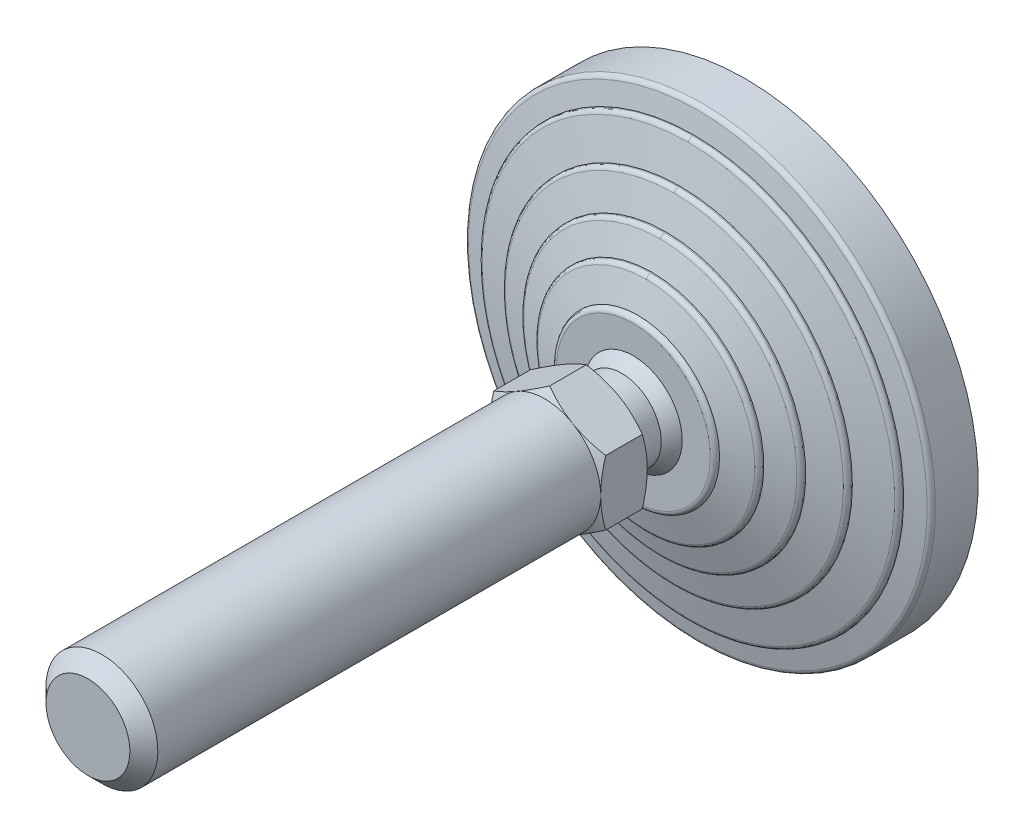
ISO-10303-21;
HEADER;
FILE_DESCRIPTION(('STEP AP214'),'2;1');
FILE_NAME('part.step','',(''),(''),'','','');
FILE_SCHEMA(('AUTOMOTIVE_DESIGN { 1 0 10303 214 1 1 1 1 }'));
ENDSEC;
DATA;
#1=APPLICATION_CONTEXT('core data for automotive mechanical design processes');
#2=APPLICATION_PROTOCOL_DEFINITION('international standard','automotive_design',2000,#1);
#3=PRODUCT_CONTEXT('',#1,'mechanical');
#4=PRODUCT('Part','Part','',(#3));
#5=PRODUCT_RELATED_PRODUCT_CATEGORY('part','',(#4));
#6=PRODUCT_DEFINITION_FORMATION('','',#4);
#7=PRODUCT_DEFINITION_CONTEXT('part definition',#1,'design');
#8=PRODUCT_DEFINITION('design','',#6,#7);
#9=PRODUCT_DEFINITION_SHAPE('','',#8);
#10=(LENGTH_UNIT() NAMED_UNIT(*) SI_UNIT(.MILLI.,.METRE.));
#11=(NAMED_UNIT(*) PLANE_ANGLE_UNIT() SI_UNIT($,.RADIAN.));
#12=(NAMED_UNIT(*) SI_UNIT($,.STERADIAN.) SOLID_ANGLE_UNIT());
#13=UNCERTAINTY_MEASURE_WITH_UNIT(LENGTH_MEASURE(1.E-05),#10,'distance_accuracy_value','');
#14=(GEOMETRIC_REPRESENTATION_CONTEXT(3) GLOBAL_UNCERTAINTY_ASSIGNED_CONTEXT((#13)) GLOBAL_UNIT_ASSIGNED_CONTEXT((#10,
#11,#12)) REPRESENTATION_CONTEXT('',''));
#15=CARTESIAN_POINT('',(0.,0.,0.));
#16=DIRECTION('',(0.,0.,1.));
#17=DIRECTION('',(1.,0.,0.));
#18=AXIS2_PLACEMENT_3D('',#15,#16,#17);
#19=CARTESIAN_POINT('',(-44.173478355,44.022,0.));
#20=DIRECTION('',(0.,0.,1.));
#21=DIRECTION('',(0.,-1.,0.));
#22=AXIS2_PLACEMENT_3D('',#19,#20,#21);
#23=PLANE('',#22);
#24=CARTESIAN_POINT('',(0.,0.,0.));
#25=DIRECTION('',(0.,0.,-1.));
#26=DIRECTION('',(0.,1.,0.));
#27=AXIS2_PLACEMENT_3D('',#24,#25,#26);
#28=CIRCLE('',#27,43.5);
#29=CARTESIAN_POINT('',(0.,43.5,0.));
#30=VERTEX_POINT('',#29);
#31=EDGE_CURVE('E449',#30,#30,#28,.F.);
#32=ORIENTED_EDGE('',*,*,#31,.F.);
#33=EDGE_LOOP('',(#32));
#34=FACE_BOUND('',#33,.T.);
#35=ADVANCED_FACE('F14',(#34),#23,.F.);
#36=CARTESIAN_POINT('',(0.,0.,3.));
#37=DIRECTION('',(0.,0.,-1.));
#38=DIRECTION('',(0.,1.,0.));
#39=AXIS2_PLACEMENT_3D('',#36,#37,#38);
#40=CYLINDRICAL_SURFACE('',#39,43.5);
#41=ORIENTED_EDGE('',*,*,#31,.T.);
#42=EDGE_LOOP('',(#41));
#43=FACE_BOUND('',#42,.T.);
#44=CARTESIAN_POINT('',(0.,0.,3.));
#45=DIRECTION('',(0.,0.,-1.));
#46=DIRECTION('',(0.,1.,0.));
#47=AXIS2_PLACEMENT_3D('',#44,#45,#46);
#48=CIRCLE('',#47,43.5);
#49=CARTESIAN_POINT('',(0.,43.5,3.));
#50=VERTEX_POINT('',#49);
#51=EDGE_CURVE('E452',#50,#50,#48,.T.);
#52=ORIENTED_EDGE('',*,*,#51,.T.);
#53=EDGE_LOOP('',(#52));
#54=FACE_BOUND('',#53,.T.);
#55=ADVANCED_FACE('F296',(#43,#54),#40,.T.);
#56=CARTESIAN_POINT('',(-50.774113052,50.6,3.));
#57=DIRECTION('',(0.,0.,1.));
#58=DIRECTION('',(0.,-1.,0.));
#59=AXIS2_PLACEMENT_3D('',#56,#57,#58);
#60=PLANE('',#59);
#61=ORIENTED_EDGE('',*,*,#51,.F.);
#62=EDGE_LOOP('',(#61));
#63=FACE_BOUND('',#62,.T.);
#64=CARTESIAN_POINT('',(0.,0.,3.));
#65=DIRECTION('',(0.,0.,-1.));
#66=DIRECTION('',(0.,1.,0.));
#67=AXIS2_PLACEMENT_3D('',#64,#65,#66);
#68=CIRCLE('',#67,50.);
#69=CARTESIAN_POINT('',(0.,50.,3.));
#70=VERTEX_POINT('',#69);
#71=EDGE_CURVE('E453',#70,#70,#68,.F.);
#72=ORIENTED_EDGE('',*,*,#71,.F.);
#73=EDGE_LOOP('',(#72));
#74=FACE_BOUND('',#73,.T.);
#75=ADVANCED_FACE('F293',(#63,#74),#60,.F.);
#76=CARTESIAN_POINT('',(0.,0.,12.180196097));
#77=DIRECTION('',(0.,0.,-1.));
#78=DIRECTION('',(0.,1.,0.));
#79=AXIS2_PLACEMENT_3D('',#76,#77,#78);
#80=CYLINDRICAL_SURFACE('',#79,50.);
#81=ORIENTED_EDGE('',*,*,#71,.T.);
#82=EDGE_LOOP('',(#81));
#83=FACE_BOUND('',#82,.T.);
#84=CARTESIAN_POINT('',(0.,0.,12.180196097));
#85=DIRECTION('',(0.,0.,1.));
#86=DIRECTION('',(0.,-1.,0.));
#87=AXIS2_PLACEMENT_3D('',#84,#85,#86);
#88=CIRCLE('',#87,50.);
#89=CARTESIAN_POINT('',(0.,-50.,12.180196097));
#90=VERTEX_POINT('',#89);
#91=EDGE_CURVE('E456',#90,#90,#88,.T.);
#92=ORIENTED_EDGE('',*,*,#91,.F.);
#93=EDGE_LOOP('',(#92));
#94=FACE_BOUND('',#93,.T.);
#95=ADVANCED_FACE('F291',(#83,#94),#80,.T.);
#96=CARTESIAN_POINT('',(0.,0.,12.180196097));
#97=DIRECTION('',(0.,0.,-1.));
#98=DIRECTION('',(0.,1.,0.));
#99=AXIS2_PLACEMENT_3D('',#96,#97,#98);
#100=TOROIDAL_SURFACE('',#99,48.9999999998,1.0000000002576);
#101=ORIENTED_EDGE('',*,*,#91,.T.);
#102=EDGE_LOOP('',(#101));
#103=FACE_BOUND('',#102,.T.);
#104=CARTESIAN_POINT('',(0.,0.,13.160776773));
#105=DIRECTION('',(0.,0.,-1.));
#106=DIRECTION('',(0.,1.,0.));
#107=AXIS2_PLACEMENT_3D('',#104,#105,#106);
#108=CIRCLE('',#107,49.196116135);
#109=CARTESIAN_POINT('',(0.,49.196116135,13.160776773));
#110=VERTEX_POINT('',#109);
#111=EDGE_CURVE('E665',#110,#110,#108,.F.);
#112=ORIENTED_EDGE('',*,*,#111,.F.);
#113=EDGE_LOOP('',(#112));
#114=FACE_BOUND('',#113,.T.);
#115=ADVANCED_FACE('F287',(#103,#114),#100,.T.);
#116=CARTESIAN_POINT('',(0.,0.,14.));
#117=DIRECTION('',(0.,0.,-1.));
#118=DIRECTION('',(1.,0.,0.));
#119=AXIS2_PLACEMENT_3D('',#116,#117,#118);
#120=CONICAL_SURFACE('',#119,45.,1.37340076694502);
#121=ORIENTED_EDGE('',*,*,#111,.T.);
#122=EDGE_LOOP('',(#121));
#123=FACE_BOUND('',#122,.T.);
#124=CARTESIAN_POINT('',(0.,0.,14.));
#125=DIRECTION('',(0.,0.,-1.));
#126=DIRECTION('',(0.,1.,0.));
#127=AXIS2_PLACEMENT_3D('',#124,#125,#126);
#128=CIRCLE('',#127,45.);
#129=CARTESIAN_POINT('',(0.,45.,14.));
#130=VERTEX_POINT('',#129);
#131=EDGE_CURVE('E656',#130,#130,#128,.F.);
#132=ORIENTED_EDGE('',*,*,#131,.F.);
#133=EDGE_LOOP('',(#132));
#134=FACE_BOUND('',#133,.T.);
#135=ADVANCED_FACE('F290',(#123,#134),#120,.T.);
#136=CARTESIAN_POINT('',(0.,0.,14.219223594));
#137=DIRECTION('',(0.,0.,-1.));
#138=DIRECTION('',(1.,0.,0.));
#139=AXIS2_PLACEMENT_3D('',#136,#137,#138);
#140=CYLINDRICAL_SURFACE('',#139,45.);
#141=ORIENTED_EDGE('',*,*,#131,.T.);
#142=EDGE_LOOP('',(#141));
#143=FACE_BOUND('',#142,.T.);
#144=CARTESIAN_POINT('',(0.,0.,14.219223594));
#145=DIRECTION('',(0.,0.,1.));
#146=DIRECTION('',(-1.,0.,0.));
#147=AXIS2_PLACEMENT_3D('',#144,#145,#146);
#148=CIRCLE('',#147,45.);
#149=CARTESIAN_POINT('',(-4.61482714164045E-09,-45.,14.219223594));
#150=VERTEX_POINT('',#149);
#151=CARTESIAN_POINT('',(0.,45.,14.219223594));
#152=VERTEX_POINT('',#151);
#153=EDGE_CURVE('E636',#150,#152,#148,.T.);
#154=ORIENTED_EDGE('',*,*,#153,.F.);
#155=CARTESIAN_POINT('',(0.,0.,14.219223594));
#156=DIRECTION('',(0.,0.,1.));
#157=DIRECTION('',(-1.,0.,0.));
#158=AXIS2_PLACEMENT_3D('',#155,#156,#157);
#159=CIRCLE('',#158,45.);
#160=EDGE_CURVE('E647',#152,#150,#159,.T.);
#161=ORIENTED_EDGE('',*,*,#160,.F.);
#162=EDGE_LOOP('',(#154,#161));
#163=FACE_BOUND('',#162,.T.);
#164=ADVANCED_FACE('F425',(#143,#163),#140,.T.);
#165=CARTESIAN_POINT('',(0.,-45.,14.219223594));
#166=CARTESIAN_POINT('',(-90.0000000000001,-45.,14.219223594));
#167=CARTESIAN_POINT('',(-90.0000000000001,45.,14.219223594));
#168=CARTESIAN_POINT('',(0.,45.,14.219223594));
#169=CARTESIAN_POINT('',(0.,-45.,14.696951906));
#170=CARTESIAN_POINT('',(-90.,-45.,14.696951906));
#171=CARTESIAN_POINT('',(-90.,45.,14.696951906));
#172=CARTESIAN_POINT('',(0.,45.,14.696951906));
#173=CARTESIAN_POINT('',(0.,-44.706000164,15.073499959));
#174=CARTESIAN_POINT('',(-89.412000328,-44.706000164,15.073499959));
#175=CARTESIAN_POINT('',(-89.412000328,44.706000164,15.073499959));
#176=CARTESIAN_POINT('',(0.,44.706000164,15.073499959));
#177=CARTESIAN_POINT('',(0.,-44.242535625,15.189366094));
#178=CARTESIAN_POINT('',(-88.4850712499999,-44.2425356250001,15.189366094));
#179=CARTESIAN_POINT('',(-88.4850712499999,44.2425356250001,15.189366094));
#180=CARTESIAN_POINT('',(0.,44.242535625,15.189366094));
#181=(BOUNDED_SURFACE() B_SPLINE_SURFACE(3,3,((#165,#166,#167,#168),(#169,#170,#171,#172),(#173,
#174,#175,#176),(#177,#178,#179,#180)),.UNSPECIFIED.,.F.,.F.,
.F.) B_SPLINE_SURFACE_WITH_KNOTS((4,4),(4,4),(0.,1.),(0.,1.),
.UNSPECIFIED.) GEOMETRIC_REPRESENTATION_ITEM() RATIONAL_B_SPLINE_SURFACE(((1.,0.333333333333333,
0.333333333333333,1.),(0.858803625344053,0.286267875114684,0.286267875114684,0.858803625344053),
(0.858803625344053,0.286267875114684,0.286267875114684,0.858803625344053),(1.,0.333333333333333,
0.333333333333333,1.))) REPRESENTATION_ITEM('') SURFACE());
#182=CARTESIAN_POINT('',(0.,45.,14.219223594));
#183=CARTESIAN_POINT('',(0.,45.,14.696951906));
#184=CARTESIAN_POINT('',(0.,44.706000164,15.073499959));
#185=CARTESIAN_POINT('',(0.,44.242535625,15.189366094));
#186=(BOUNDED_CURVE() B_SPLINE_CURVE(3,(#182,#183,#184,#185),.UNSPECIFIED.,.F.,
.F.) B_SPLINE_CURVE_WITH_KNOTS((4,4),(0.,1.),
.UNSPECIFIED.) CURVE() GEOMETRIC_REPRESENTATION_ITEM() RATIONAL_B_SPLINE_CURVE((1.,
0.858803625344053,0.858803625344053,1.)) REPRESENTATION_ITEM(''));
#187=CARTESIAN_POINT('',(0.,44.2425356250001,15.1893660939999));
#188=VERTEX_POINT('',#187);
#189=EDGE_CURVE('E627',#152,#188,#186,.T.);
#190=CARTESIAN_POINT('',(0.,-45.,14.219223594));
#191=CARTESIAN_POINT('',(0.,-45.,14.696951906));
#192=CARTESIAN_POINT('',(0.,-44.706000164,15.073499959));
#193=CARTESIAN_POINT('',(0.,-44.242535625,15.189366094));
#194=(BOUNDED_CURVE() B_SPLINE_CURVE(3,(#190,#191,#192,#193),.UNSPECIFIED.,.F.,
.F.) B_SPLINE_CURVE_WITH_KNOTS((4,4),(0.,1.),
.UNSPECIFIED.) CURVE() GEOMETRIC_REPRESENTATION_ITEM() RATIONAL_B_SPLINE_CURVE((1.,
0.858803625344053,0.858803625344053,1.)) REPRESENTATION_ITEM(''));
#195=CARTESIAN_POINT('',(-1.3611443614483E-08,-44.2425356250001,15.1893660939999));
#196=VERTEX_POINT('',#195);
#197=EDGE_CURVE('E641',#196,#150,#194,.F.);
#198=CARTESIAN_POINT('',(0.,0.,15.1893660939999));
#199=DIRECTION('',(0.,0.,-1.));
#200=DIRECTION('',(0.,1.,0.));
#201=AXIS2_PLACEMENT_3D('',#198,#199,#200);
#202=CIRCLE('',#201,44.242535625);
#203=EDGE_CURVE('E624',#188,#196,#202,.F.);
#204=ORIENTED_EDGE('',*,*,#189,.F.);
#205=ORIENTED_EDGE('',*,*,#160,.T.);
#206=ORIENTED_EDGE('',*,*,#197,.F.);
#207=ORIENTED_EDGE('',*,*,#203,.F.);
#208=EDGE_LOOP('',(#204,#205,#206,#207));
#209=FACE_BOUND('',#208,.T.);
#210=ADVANCED_FACE('F414',(#209),#181,.T.);
#211=CARTESIAN_POINT('',(0.,45.,14.219223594));
#212=CARTESIAN_POINT('',(90.0000000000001,45.,14.219223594));
#213=CARTESIAN_POINT('',(90.0000000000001,-45.,14.219223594));
#214=CARTESIAN_POINT('',(0.,-45.,14.219223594));
#215=CARTESIAN_POINT('',(0.,45.,14.696951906));
#216=CARTESIAN_POINT('',(90.,45.,14.696951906));
#217=CARTESIAN_POINT('',(90.,-45.,14.696951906));
#218=CARTESIAN_POINT('',(0.,-45.,14.696951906));
#219=CARTESIAN_POINT('',(0.,44.706000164,15.073499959));
#220=CARTESIAN_POINT('',(89.412000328,44.706000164,15.073499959));
#221=CARTESIAN_POINT('',(89.412000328,-44.706000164,15.073499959));
#222=CARTESIAN_POINT('',(0.,-44.706000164,15.073499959));
#223=CARTESIAN_POINT('',(0.,44.242535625,15.189366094));
#224=CARTESIAN_POINT('',(88.4850712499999,44.2425356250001,15.189366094));
#225=CARTESIAN_POINT('',(88.4850712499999,-44.2425356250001,15.189366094));
#226=CARTESIAN_POINT('',(0.,-44.242535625,15.189366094));
#227=(BOUNDED_SURFACE() B_SPLINE_SURFACE(3,3,((#211,#212,#213,#214),(#215,#216,#217,#218),(#219,
#220,#221,#222),(#223,#224,#225,#226)),.UNSPECIFIED.,.F.,.F.,
.F.) B_SPLINE_SURFACE_WITH_KNOTS((4,4),(4,4),(0.,1.),(0.,1.),
.UNSPECIFIED.) GEOMETRIC_REPRESENTATION_ITEM() RATIONAL_B_SPLINE_SURFACE(((1.,0.333333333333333,
0.333333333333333,1.),(0.858803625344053,0.286267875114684,0.286267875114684,0.858803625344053),
(0.858803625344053,0.286267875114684,0.286267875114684,0.858803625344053),(1.,0.333333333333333,
0.333333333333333,1.))) REPRESENTATION_ITEM('') SURFACE());
#228=CARTESIAN_POINT('',(0.,0.,15.1893660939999));
#229=DIRECTION('',(0.,0.,-1.));
#230=DIRECTION('',(0.,1.,0.));
#231=AXIS2_PLACEMENT_3D('',#228,#229,#230);
#232=CIRCLE('',#231,44.242535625);
#233=EDGE_CURVE('E623',#196,#188,#232,.F.);
#234=ORIENTED_EDGE('',*,*,#153,.T.);
#235=ORIENTED_EDGE('',*,*,#189,.T.);
#236=ORIENTED_EDGE('',*,*,#233,.F.);
#237=ORIENTED_EDGE('',*,*,#197,.T.);
#238=EDGE_LOOP('',(#234,#235,#236,#237));
#239=FACE_BOUND('',#238,.T.);
#240=ADVANCED_FACE('F408',(#239),#227,.T.);
#241=CARTESIAN_POINT('',(0.,0.,17.));
#242=DIRECTION('',(0.,0.,-1.));
#243=DIRECTION('',(0.,1.,0.));
#244=AXIS2_PLACEMENT_3D('',#241,#242,#243);
#245=CONICAL_SURFACE('',#244,37.,1.32581766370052);
#246=ORIENTED_EDGE('',*,*,#203,.T.);
#247=ORIENTED_EDGE('',*,*,#233,.T.);
#248=EDGE_LOOP('',(#246,#247));
#249=FACE_BOUND('',#248,.T.);
#250=CARTESIAN_POINT('',(0.,0.,17.));
#251=DIRECTION('',(0.,0.,-1.));
#252=DIRECTION('',(0.,1.,0.));
#253=AXIS2_PLACEMENT_3D('',#250,#251,#252);
#254=CIRCLE('',#253,37.);
#255=CARTESIAN_POINT('',(0.,37.,17.));
#256=VERTEX_POINT('',#255);
#257=EDGE_CURVE('E614',#256,#256,#254,.F.);
#258=ORIENTED_EDGE('',*,*,#257,.F.);
#259=EDGE_LOOP('',(#258));
#260=FACE_BOUND('',#259,.T.);
#261=ADVANCED_FACE('F404',(#249,#260),#245,.T.);
#262=CARTESIAN_POINT('',(0.,0.,17.245698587));
#263=DIRECTION('',(0.,0.,-1.));
#264=DIRECTION('',(1.,0.,0.));
#265=AXIS2_PLACEMENT_3D('',#262,#263,#264);
#266=CYLINDRICAL_SURFACE('',#265,37.);
#267=ORIENTED_EDGE('',*,*,#257,.T.);
#268=EDGE_LOOP('',(#267));
#269=FACE_BOUND('',#268,.T.);
#270=CARTESIAN_POINT('',(0.,0.,17.245698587));
#271=DIRECTION('',(0.,0.,1.));
#272=DIRECTION('',(0.,-1.,0.));
#273=AXIS2_PLACEMENT_3D('',#270,#271,#272);
#274=CIRCLE('',#273,37.);
#275=CARTESIAN_POINT('',(-3.79441342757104E-09,-37.,17.245698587));
#276=VERTEX_POINT('',#275);
#277=CARTESIAN_POINT('',(0.,37.,17.245698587));
#278=VERTEX_POINT('',#277);
#279=EDGE_CURVE('E594',#276,#278,#274,.T.);
#280=ORIENTED_EDGE('',*,*,#279,.F.);
#281=CARTESIAN_POINT('',(0.,0.,17.245698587));
#282=DIRECTION('',(0.,0.,1.));
#283=DIRECTION('',(0.,-1.,0.));
#284=AXIS2_PLACEMENT_3D('',#281,#282,#283);
#285=CIRCLE('',#284,37.);
#286=EDGE_CURVE('E605',#278,#276,#285,.T.);
#287=ORIENTED_EDGE('',*,*,#286,.F.);
#288=EDGE_LOOP('',(#280,#287));
#289=FACE_BOUND('',#288,.T.);
#290=ADVANCED_FACE('F395',(#269,#289),#266,.T.);
#291=CARTESIAN_POINT('',(0.,-37.,17.245698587));
#292=CARTESIAN_POINT('',(-74.,-37.,17.245698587));
#293=CARTESIAN_POINT('',(-74.,37.,17.245698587));
#294=CARTESIAN_POINT('',(0.,37.,17.245698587));
#295=CARTESIAN_POINT('',(0.,-37.,17.709515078));
#296=CARTESIAN_POINT('',(-74.,-37.,17.709515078));
#297=CARTESIAN_POINT('',(-74.,37.,17.709515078));
#298=CARTESIAN_POINT('',(0.,37.,17.709515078));
#299=CARTESIAN_POINT('',(0.,-36.720691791,18.079802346));
#300=CARTESIAN_POINT('',(-73.441383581,-36.720691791,18.079802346));
#301=CARTESIAN_POINT('',(-73.441383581,36.720691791,18.079802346));
#302=CARTESIAN_POINT('',(0.,36.720691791,18.079802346));
#303=CARTESIAN_POINT('',(0.,-36.274721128,18.207222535));
#304=CARTESIAN_POINT('',(-72.549442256,-36.274721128,18.207222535));
#305=CARTESIAN_POINT('',(-72.549442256,36.274721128,18.207222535));
#306=CARTESIAN_POINT('',(0.,36.274721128,18.207222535));
#307=(BOUNDED_SURFACE() B_SPLINE_SURFACE(3,3,((#291,#292,#293,#294),(#295,#296,#297,#298),(#299,
#300,#301,#302),(#303,#304,#305,#306)),.UNSPECIFIED.,.F.,.F.,
.F.) B_SPLINE_SURFACE_WITH_KNOTS((4,4),(4,4),(0.,1.),(0.,1.),
.UNSPECIFIED.) GEOMETRIC_REPRESENTATION_ITEM() RATIONAL_B_SPLINE_SURFACE(((1.,0.333333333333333,
0.333333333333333,1.),(0.865565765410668,0.288521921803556,0.288521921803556,0.865565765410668),
(0.865565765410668,0.288521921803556,0.288521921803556,0.865565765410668),(1.,0.333333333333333,
0.333333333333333,1.))) REPRESENTATION_ITEM('') SURFACE());
#308=CARTESIAN_POINT('',(0.,37.,17.245698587));
#309=CARTESIAN_POINT('',(0.,37.,17.709515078));
#310=CARTESIAN_POINT('',(0.,36.720691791,18.079802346));
#311=CARTESIAN_POINT('',(0.,36.274721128,18.207222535));
#312=(BOUNDED_CURVE() B_SPLINE_CURVE(3,(#308,#309,#310,#311),.UNSPECIFIED.,.F.,
.F.) B_SPLINE_CURVE_WITH_KNOTS((4,4),(0.,1.),
.UNSPECIFIED.) CURVE() GEOMETRIC_REPRESENTATION_ITEM() RATIONAL_B_SPLINE_CURVE((1.,
0.865565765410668,0.865565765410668,1.)) REPRESENTATION_ITEM(''));
#313=CARTESIAN_POINT('',(0.,36.2747211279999,18.207222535));
#314=VERTEX_POINT('',#313);
#315=EDGE_CURVE('E585',#278,#314,#312,.T.);
#316=CARTESIAN_POINT('',(0.,-37.,17.245698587));
#317=CARTESIAN_POINT('',(0.,-37.,17.709515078));
#318=CARTESIAN_POINT('',(0.,-36.720691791,18.079802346));
#319=CARTESIAN_POINT('',(0.,-36.274721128,18.207222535));
#320=(BOUNDED_CURVE() B_SPLINE_CURVE(3,(#316,#317,#318,#319),.UNSPECIFIED.,.F.,
.F.) B_SPLINE_CURVE_WITH_KNOTS((4,4),(0.,1.),
.UNSPECIFIED.) CURVE() GEOMETRIC_REPRESENTATION_ITEM() RATIONAL_B_SPLINE_CURVE((1.,
0.865565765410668,0.865565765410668,1.)) REPRESENTATION_ITEM(''));
#321=CARTESIAN_POINT('',(-1.11601045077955E-08,-36.2747211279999,18.207222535));
#322=VERTEX_POINT('',#321);
#323=EDGE_CURVE('E599',#322,#276,#320,.F.);
#324=CARTESIAN_POINT('',(0.,0.,18.207222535));
#325=DIRECTION('',(0.,0.,-1.));
#326=DIRECTION('',(0.,1.,0.));
#327=AXIS2_PLACEMENT_3D('',#324,#325,#326);
#328=CIRCLE('',#327,36.274721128);
#329=EDGE_CURVE('E582',#314,#322,#328,.F.);
#330=ORIENTED_EDGE('',*,*,#315,.F.);
#331=ORIENTED_EDGE('',*,*,#286,.T.);
#332=ORIENTED_EDGE('',*,*,#323,.F.);
#333=ORIENTED_EDGE('',*,*,#329,.F.);
#334=EDGE_LOOP('',(#330,#331,#332,#333));
#335=FACE_BOUND('',#334,.T.);
#336=ADVANCED_FACE('F384',(#335),#307,.T.);
#337=CARTESIAN_POINT('',(0.,37.,17.245698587));
#338=CARTESIAN_POINT('',(74.,37.,17.245698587));
#339=CARTESIAN_POINT('',(74.,-37.,17.245698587));
#340=CARTESIAN_POINT('',(0.,-37.,17.245698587));
#341=CARTESIAN_POINT('',(0.,37.,17.709515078));
#342=CARTESIAN_POINT('',(74.,37.,17.709515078));
#343=CARTESIAN_POINT('',(74.,-37.,17.709515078));
#344=CARTESIAN_POINT('',(0.,-37.,17.709515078));
#345=CARTESIAN_POINT('',(0.,36.720691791,18.079802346));
#346=CARTESIAN_POINT('',(73.441383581,36.720691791,18.079802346));
#347=CARTESIAN_POINT('',(73.441383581,-36.720691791,18.079802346));
#348=CARTESIAN_POINT('',(0.,-36.720691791,18.079802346));
#349=CARTESIAN_POINT('',(0.,36.274721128,18.207222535));
#350=CARTESIAN_POINT('',(72.549442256,36.274721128,18.207222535));
#351=CARTESIAN_POINT('',(72.549442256,-36.274721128,18.207222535));
#352=CARTESIAN_POINT('',(0.,-36.274721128,18.207222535));
#353=(BOUNDED_SURFACE() B_SPLINE_SURFACE(3,3,((#337,#338,#339,#340),(#341,#342,#343,#344),(#345,
#346,#347,#348),(#349,#350,#351,#352)),.UNSPECIFIED.,.F.,.F.,
.F.) B_SPLINE_SURFACE_WITH_KNOTS((4,4),(4,4),(0.,1.),(0.,1.),
.UNSPECIFIED.) GEOMETRIC_REPRESENTATION_ITEM() RATIONAL_B_SPLINE_SURFACE(((1.,0.333333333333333,
0.333333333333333,1.),(0.865565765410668,0.288521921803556,0.288521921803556,0.865565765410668),
(0.865565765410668,0.288521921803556,0.288521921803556,0.865565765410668),(1.,0.333333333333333,
0.333333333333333,1.))) REPRESENTATION_ITEM('') SURFACE());
#354=CARTESIAN_POINT('',(0.,0.,18.207222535));
#355=DIRECTION('',(0.,0.,-1.));
#356=DIRECTION('',(0.,1.,0.));
#357=AXIS2_PLACEMENT_3D('',#354,#355,#356);
#358=CIRCLE('',#357,36.274721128);
#359=EDGE_CURVE('E581',#322,#314,#358,.F.);
#360=ORIENTED_EDGE('',*,*,#279,.T.);
#361=ORIENTED_EDGE('',*,*,#315,.T.);
#362=ORIENTED_EDGE('',*,*,#359,.F.);
#363=ORIENTED_EDGE('',*,*,#323,.T.);
#364=EDGE_LOOP('',(#360,#361,#362,#363));
#365=FACE_BOUND('',#364,.T.);
#366=ADVANCED_FACE('F378',(#365),#353,.T.);
#367=CARTESIAN_POINT('',(0.,0.,20.));
#368=DIRECTION('',(0.,0.,-1.));
#369=DIRECTION('',(1.,0.,0.));
#370=AXIS2_PLACEMENT_3D('',#367,#368,#369);
#371=CONICAL_SURFACE('',#370,30.,1.29249666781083);
#372=ORIENTED_EDGE('',*,*,#329,.T.);
#373=ORIENTED_EDGE('',*,*,#359,.T.);
#374=EDGE_LOOP('',(#372,#373));
#375=FACE_BOUND('',#374,.T.);
#376=CARTESIAN_POINT('',(0.,0.,20.));
#377=DIRECTION('',(0.,0.,-1.));
#378=DIRECTION('',(0.,1.,0.));
#379=AXIS2_PLACEMENT_3D('',#376,#377,#378);
#380=CIRCLE('',#379,30.);
#381=CARTESIAN_POINT('',(0.,30.,20.));
#382=VERTEX_POINT('',#381);
#383=EDGE_CURVE('E572',#382,#382,#380,.F.);
#384=ORIENTED_EDGE('',*,*,#383,.F.);
#385=EDGE_LOOP('',(#384));
#386=FACE_BOUND('',#385,.T.);
#387=ADVANCED_FACE('F374',(#375,#386),#371,.T.);
#388=CARTESIAN_POINT('',(0.,0.,20.27924078));
#389=DIRECTION('',(0.,0.,-1.));
#390=DIRECTION('',(0.,1.,0.));
#391=AXIS2_PLACEMENT_3D('',#388,#389,#390);
#392=CYLINDRICAL_SURFACE('',#391,30.);
#393=ORIENTED_EDGE('',*,*,#383,.T.);
#394=EDGE_LOOP('',(#393));
#395=FACE_BOUND('',#394,.T.);
#396=CARTESIAN_POINT('',(0.,0.,20.27924078));
#397=DIRECTION('',(0.,0.,1.));
#398=DIRECTION('',(0.,-1.,0.));
#399=AXIS2_PLACEMENT_3D('',#396,#397,#398);
#400=CIRCLE('',#399,30.);
#401=CARTESIAN_POINT('',(-3.0765514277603E-09,-30.,20.27924078));
#402=VERTEX_POINT('',#401);
#403=CARTESIAN_POINT('',(0.,30.,20.27924078));
#404=VERTEX_POINT('',#403);
#405=EDGE_CURVE('E552',#402,#404,#400,.T.);
#406=ORIENTED_EDGE('',*,*,#405,.F.);
#407=CARTESIAN_POINT('',(0.,0.,20.27924078));
#408=DIRECTION('',(0.,0.,1.));
#409=DIRECTION('',(0.,-1.,0.));
#410=AXIS2_PLACEMENT_3D('',#407,#408,#409);
#411=CIRCLE('',#410,30.);
#412=EDGE_CURVE('E563',#404,#402,#411,.T.);
#413=ORIENTED_EDGE('',*,*,#412,.F.);
#414=EDGE_LOOP('',(#406,#413));
#415=FACE_BOUND('',#414,.T.);
#416=ADVANCED_FACE('F365',(#395,#415),#392,.T.);
#417=CARTESIAN_POINT('',(0.,-30.,20.27924078));
#418=CARTESIAN_POINT('',(-60.0000000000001,-30.,20.27924078));
#419=CARTESIAN_POINT('',(-60.0000000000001,30.,20.27924078));
#420=CARTESIAN_POINT('',(0.,30.,20.27924078));
#421=CARTESIAN_POINT('',(0.,-30.,20.725161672));
#422=CARTESIAN_POINT('',(-60.,-30.,20.725161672));
#423=CARTESIAN_POINT('',(-60.,30.,20.725161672));
#424=CARTESIAN_POINT('',(0.,30.,20.725161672));
#425=CARTESIAN_POINT('',(0.,-29.739265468,21.086911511));
#426=CARTESIAN_POINT('',(-59.4785309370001,-29.739265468,21.086911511));
#427=CARTESIAN_POINT('',(-59.4785309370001,29.739265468,21.086911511));
#428=CARTESIAN_POINT('',(0.,29.739265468,21.086911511));
#429=CARTESIAN_POINT('',(0.,-29.316227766,21.227924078));
#430=CARTESIAN_POINT('',(-58.6324555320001,-29.316227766,21.227924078));
#431=CARTESIAN_POINT('',(-58.6324555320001,29.316227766,21.227924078));
#432=CARTESIAN_POINT('',(0.,29.316227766,21.227924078));
#433=(BOUNDED_SURFACE() B_SPLINE_SURFACE(3,3,((#417,#418,#419,#420),(#421,#422,#423,#424),(#425,
#426,#427,#428),(#429,#430,#431,#432)),.UNSPECIFIED.,.F.,.F.,
.F.) B_SPLINE_SURFACE_WITH_KNOTS((4,4),(4,4),(0.,1.),(0.,1.),
.UNSPECIFIED.) GEOMETRIC_REPRESENTATION_ITEM() RATIONAL_B_SPLINE_SURFACE(((1.,0.333333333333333,
0.333333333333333,1.),(0.874161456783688,0.291387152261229,0.291387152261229,0.874161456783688),
(0.874161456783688,0.291387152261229,0.291387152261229,0.874161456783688),(1.,0.333333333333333,
0.333333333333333,1.))) REPRESENTATION_ITEM('') SURFACE());
#434=CARTESIAN_POINT('',(0.,30.,20.27924078));
#435=CARTESIAN_POINT('',(0.,30.,20.725161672));
#436=CARTESIAN_POINT('',(0.,29.739265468,21.086911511));
#437=CARTESIAN_POINT('',(0.,29.316227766,21.227924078));
#438=(BOUNDED_CURVE() B_SPLINE_CURVE(3,(#434,#435,#436,#437),.UNSPECIFIED.,.F.,
.F.) B_SPLINE_CURVE_WITH_KNOTS((4,4),(0.,1.),
.UNSPECIFIED.) CURVE() GEOMETRIC_REPRESENTATION_ITEM() RATIONAL_B_SPLINE_CURVE((1.,
0.874161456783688,0.874161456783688,1.)) REPRESENTATION_ITEM(''));
#439=CARTESIAN_POINT('',(0.,29.316227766,21.227924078));
#440=VERTEX_POINT('',#439);
#441=EDGE_CURVE('E543',#404,#440,#438,.T.);
#442=CARTESIAN_POINT('',(0.,-30.,20.27924078));
#443=CARTESIAN_POINT('',(0.,-30.,20.725161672));
#444=CARTESIAN_POINT('',(0.,-29.739265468,21.086911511));
#445=CARTESIAN_POINT('',(0.,-29.316227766,21.227924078));
#446=(BOUNDED_CURVE() B_SPLINE_CURVE(3,(#442,#443,#444,#445),.UNSPECIFIED.,.F.,
.F.) B_SPLINE_CURVE_WITH_KNOTS((4,4),(0.,1.),
.UNSPECIFIED.) CURVE() GEOMETRIC_REPRESENTATION_ITEM() RATIONAL_B_SPLINE_CURVE((1.,
0.874161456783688,0.874161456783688,1.)) REPRESENTATION_ITEM(''));
#447=CARTESIAN_POINT('',(-9.01928823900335E-09,-29.316227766,21.227924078));
#448=VERTEX_POINT('',#447);
#449=EDGE_CURVE('E557',#448,#402,#446,.F.);
#450=CARTESIAN_POINT('',(0.,0.,21.227924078));
#451=DIRECTION('',(0.,0.,-1.));
#452=DIRECTION('',(0.,1.,0.));
#453=AXIS2_PLACEMENT_3D('',#450,#451,#452);
#454=CIRCLE('',#453,29.316227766);
#455=EDGE_CURVE('E540',#440,#448,#454,.F.);
#456=ORIENTED_EDGE('',*,*,#441,.F.);
#457=ORIENTED_EDGE('',*,*,#412,.T.);
#458=ORIENTED_EDGE('',*,*,#449,.F.);
#459=ORIENTED_EDGE('',*,*,#455,.F.);
#460=EDGE_LOOP('',(#456,#457,#458,#459));
#461=FACE_BOUND('',#460,.T.);
#462=ADVANCED_FACE('F354',(#461),#433,.T.);
#463=CARTESIAN_POINT('',(0.,30.,20.27924078));
#464=CARTESIAN_POINT('',(60.0000000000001,30.,20.27924078));
#465=CARTESIAN_POINT('',(60.0000000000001,-30.,20.27924078));
#466=CARTESIAN_POINT('',(0.,-30.,20.27924078));
#467=CARTESIAN_POINT('',(0.,30.,20.725161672));
#468=CARTESIAN_POINT('',(60.,30.,20.725161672));
#469=CARTESIAN_POINT('',(60.,-30.,20.725161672));
#470=CARTESIAN_POINT('',(0.,-30.,20.725161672));
#471=CARTESIAN_POINT('',(0.,29.739265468,21.086911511));
#472=CARTESIAN_POINT('',(59.4785309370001,29.739265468,21.086911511));
#473=CARTESIAN_POINT('',(59.4785309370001,-29.739265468,21.086911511));
#474=CARTESIAN_POINT('',(0.,-29.739265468,21.086911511));
#475=CARTESIAN_POINT('',(0.,29.316227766,21.227924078));
#476=CARTESIAN_POINT('',(58.6324555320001,29.316227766,21.227924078));
#477=CARTESIAN_POINT('',(58.6324555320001,-29.316227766,21.227924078));
#478=CARTESIAN_POINT('',(0.,-29.316227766,21.227924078));
#479=(BOUNDED_SURFACE() B_SPLINE_SURFACE(3,3,((#463,#464,#465,#466),(#467,#468,#469,#470),(#471,
#472,#473,#474),(#475,#476,#477,#478)),.UNSPECIFIED.,.F.,.F.,
.F.) B_SPLINE_SURFACE_WITH_KNOTS((4,4),(4,4),(0.,1.),(0.,1.),
.UNSPECIFIED.) GEOMETRIC_REPRESENTATION_ITEM() RATIONAL_B_SPLINE_SURFACE(((1.,0.333333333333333,
0.333333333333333,1.),(0.874161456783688,0.291387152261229,0.291387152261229,0.874161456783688),
(0.874161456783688,0.291387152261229,0.291387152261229,0.874161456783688),(1.,0.333333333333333,
0.333333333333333,1.))) REPRESENTATION_ITEM('') SURFACE());
#480=CARTESIAN_POINT('',(0.,0.,21.227924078));
#481=DIRECTION('',(0.,0.,-1.));
#482=DIRECTION('',(0.,1.,0.));
#483=AXIS2_PLACEMENT_3D('',#480,#481,#482);
#484=CIRCLE('',#483,29.316227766);
#485=EDGE_CURVE('E539',#448,#440,#484,.F.);
#486=ORIENTED_EDGE('',*,*,#405,.T.);
#487=ORIENTED_EDGE('',*,*,#441,.T.);
#488=ORIENTED_EDGE('',*,*,#485,.F.);
#489=ORIENTED_EDGE('',*,*,#449,.T.);
#490=EDGE_LOOP('',(#486,#487,#488,#489));
#491=FACE_BOUND('',#490,.T.);
#492=ADVANCED_FACE('F348',(#491),#479,.T.);
#493=CARTESIAN_POINT('',(0.,0.,23.));
#494=DIRECTION('',(0.,0.,-1.));
#495=DIRECTION('',(0.,1.,0.));
#496=AXIS2_PLACEMENT_3D('',#493,#494,#495);
#497=CONICAL_SURFACE('',#496,24.,1.24904577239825);
#498=ORIENTED_EDGE('',*,*,#455,.T.);
#499=ORIENTED_EDGE('',*,*,#485,.T.);
#500=EDGE_LOOP('',(#498,#499));
#501=FACE_BOUND('',#500,.T.);
#502=CARTESIAN_POINT('',(0.,0.,23.));
#503=DIRECTION('',(0.,0.,-1.));
#504=DIRECTION('',(0.,1.,0.));
#505=AXIS2_PLACEMENT_3D('',#502,#503,#504);
#506=CIRCLE('',#505,24.);
#507=CARTESIAN_POINT('',(0.,24.,23.));
#508=VERTEX_POINT('',#507);
#509=EDGE_CURVE('E530',#508,#508,#506,.F.);
#510=ORIENTED_EDGE('',*,*,#509,.F.);
#511=EDGE_LOOP('',(#510));
#512=FACE_BOUND('',#511,.T.);
#513=ADVANCED_FACE('F344',(#501,#512),#497,.T.);
#514=CARTESIAN_POINT('',(0.,0.,23.261425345));
#515=DIRECTION('',(0.,0.,-1.));
#516=DIRECTION('',(0.,1.,0.));
#517=AXIS2_PLACEMENT_3D('',#514,#515,#516);
#518=CYLINDRICAL_SURFACE('',#517,24.);
#519=ORIENTED_EDGE('',*,*,#509,.T.);
#520=EDGE_LOOP('',(#519));
#521=FACE_BOUND('',#520,.T.);
#522=CARTESIAN_POINT('',(0.,0.,23.261425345));
#523=DIRECTION('',(0.,0.,1.));
#524=DIRECTION('',(0.,-1.,0.));
#525=AXIS2_PLACEMENT_3D('',#522,#523,#524);
#526=CIRCLE('',#525,24.);
#527=CARTESIAN_POINT('',(-2.46124114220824E-09,-24.,23.261425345));
#528=VERTEX_POINT('',#527);
#529=CARTESIAN_POINT('',(0.,24.,23.261425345));
#530=VERTEX_POINT('',#529);
#531=EDGE_CURVE('E510',#528,#530,#526,.T.);
#532=ORIENTED_EDGE('',*,*,#531,.F.);
#533=CARTESIAN_POINT('',(0.,0.,23.261425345));
#534=DIRECTION('',(0.,0.,1.));
#535=DIRECTION('',(0.,-1.,0.));
#536=AXIS2_PLACEMENT_3D('',#533,#534,#535);
#537=CIRCLE('',#536,24.);
#538=EDGE_CURVE('E521',#530,#528,#537,.T.);
#539=ORIENTED_EDGE('',*,*,#538,.F.);
#540=EDGE_LOOP('',(#532,#539));
#541=FACE_BOUND('',#540,.T.);
#542=ADVANCED_FACE('F335',(#521,#541),#518,.T.);
#543=CARTESIAN_POINT('',(0.,-24.,23.261425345));
#544=CARTESIAN_POINT('',(-48.,-24.,23.261425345));
#545=CARTESIAN_POINT('',(-48.,24.,23.261425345));
#546=CARTESIAN_POINT('',(0.,24.,23.261425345));
#547=CARTESIAN_POINT('',(0.,-24.,23.716888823));
#548=CARTESIAN_POINT('',(-48.,-24.,23.716888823));
#549=CARTESIAN_POINT('',(-48.,24.,23.716888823));
#550=CARTESIAN_POINT('',(0.,24.,23.716888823));
#551=CARTESIAN_POINT('',(0.,-23.72940828,24.083258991));
#552=CARTESIAN_POINT('',(-47.458816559,-23.72940828,24.083258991));
#553=CARTESIAN_POINT('',(-47.458816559,23.72940828,24.083258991));
#554=CARTESIAN_POINT('',(0.,23.72940828,24.083258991));
#555=CARTESIAN_POINT('',(0.,-23.294085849,24.217204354));
#556=CARTESIAN_POINT('',(-46.5881716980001,-23.294085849,24.217204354));
#557=CARTESIAN_POINT('',(-46.5881716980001,23.294085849,24.217204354));
#558=CARTESIAN_POINT('',(0.,23.294085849,24.217204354));
#559=(BOUNDED_SURFACE() B_SPLINE_SURFACE(3,3,((#543,#544,#545,#546),(#547,#548,#549,#550),(#551,
#552,#553,#554),(#555,#556,#557,#558)),.UNSPECIFIED.,.F.,.F.,
.F.) B_SPLINE_SURFACE_WITH_KNOTS((4,4),(4,4),(0.,1.),(0.,1.),
.UNSPECIFIED.) GEOMETRIC_REPRESENTATION_ITEM() RATIONAL_B_SPLINE_SURFACE(((1.,0.333333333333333,
0.333333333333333,1.),(0.869593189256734,0.289864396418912,0.289864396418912,0.869593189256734),
(0.869593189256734,0.289864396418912,0.289864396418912,0.869593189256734),(1.,0.333333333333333,
0.333333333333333,1.))) REPRESENTATION_ITEM('') SURFACE());
#560=CARTESIAN_POINT('',(0.,24.,23.261425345));
#561=CARTESIAN_POINT('',(0.,24.,23.716888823));
#562=CARTESIAN_POINT('',(0.,23.72940828,24.083258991));
#563=CARTESIAN_POINT('',(0.,23.294085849,24.217204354));
#564=(BOUNDED_CURVE() B_SPLINE_CURVE(3,(#560,#561,#562,#563),.UNSPECIFIED.,.F.,
.F.) B_SPLINE_CURVE_WITH_KNOTS((4,4),(0.,1.),
.UNSPECIFIED.) CURVE() GEOMETRIC_REPRESENTATION_ITEM() RATIONAL_B_SPLINE_CURVE((1.,
0.869593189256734,0.869593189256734,1.)) REPRESENTATION_ITEM(''));
#565=CARTESIAN_POINT('',(0.,23.2940858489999,24.2172043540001));
#566=VERTEX_POINT('',#565);
#567=EDGE_CURVE('E501',#530,#566,#564,.T.);
#568=CARTESIAN_POINT('',(0.,-24.,23.261425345));
#569=CARTESIAN_POINT('',(0.,-24.,23.716888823));
#570=CARTESIAN_POINT('',(0.,-23.72940828,24.083258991));
#571=CARTESIAN_POINT('',(0.,-23.294085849,24.217204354));
#572=(BOUNDED_CURVE() B_SPLINE_CURVE(3,(#568,#569,#570,#571),.UNSPECIFIED.,.F.,
.F.) B_SPLINE_CURVE_WITH_KNOTS((4,4),(0.,1.),
.UNSPECIFIED.) CURVE() GEOMETRIC_REPRESENTATION_ITEM() RATIONAL_B_SPLINE_CURVE((1.,
0.869593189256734,0.869593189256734,1.)) REPRESENTATION_ITEM(''));
#573=CARTESIAN_POINT('',(-7.16654530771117E-09,-23.2940858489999,24.2172043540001));
#574=VERTEX_POINT('',#573);
#575=EDGE_CURVE('E515',#574,#528,#572,.F.);
#576=CARTESIAN_POINT('',(0.,0.,24.2172043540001));
#577=DIRECTION('',(0.,0.,-1.));
#578=DIRECTION('',(0.,1.,0.));
#579=AXIS2_PLACEMENT_3D('',#576,#577,#578);
#580=CIRCLE('',#579,23.294085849);
#581=EDGE_CURVE('E498',#566,#574,#580,.F.);
#582=ORIENTED_EDGE('',*,*,#567,.F.);
#583=ORIENTED_EDGE('',*,*,#538,.T.);
#584=ORIENTED_EDGE('',*,*,#575,.F.);
#585=ORIENTED_EDGE('',*,*,#581,.F.);
#586=EDGE_LOOP('',(#582,#583,#584,#585));
#587=FACE_BOUND('',#586,.T.);
#588=ADVANCED_FACE('F324',(#587),#559,.T.);
#589=CARTESIAN_POINT('',(0.,24.,23.261425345));
#590=CARTESIAN_POINT('',(48.,24.,23.261425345));
#591=CARTESIAN_POINT('',(48.,-24.,23.261425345));
#592=CARTESIAN_POINT('',(0.,-24.,23.261425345));
#593=CARTESIAN_POINT('',(0.,24.,23.716888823));
#594=CARTESIAN_POINT('',(48.,24.,23.716888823));
#595=CARTESIAN_POINT('',(48.,-24.,23.716888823));
#596=CARTESIAN_POINT('',(0.,-24.,23.716888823));
#597=CARTESIAN_POINT('',(0.,23.72940828,24.083258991));
#598=CARTESIAN_POINT('',(47.458816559,23.72940828,24.083258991));
#599=CARTESIAN_POINT('',(47.458816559,-23.72940828,24.083258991));
#600=CARTESIAN_POINT('',(0.,-23.72940828,24.083258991));
#601=CARTESIAN_POINT('',(0.,23.294085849,24.217204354));
#602=CARTESIAN_POINT('',(46.5881716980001,23.294085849,24.217204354));
#603=CARTESIAN_POINT('',(46.5881716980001,-23.294085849,24.217204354));
#604=CARTESIAN_POINT('',(0.,-23.294085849,24.217204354));
#605=(BOUNDED_SURFACE() B_SPLINE_SURFACE(3,3,((#589,#590,#591,#592),(#593,#594,#595,#596),(#597,
#598,#599,#600),(#601,#602,#603,#604)),.UNSPECIFIED.,.F.,.F.,
.F.) B_SPLINE_SURFACE_WITH_KNOTS((4,4),(4,4),(0.,1.),(0.,1.),
.UNSPECIFIED.) GEOMETRIC_REPRESENTATION_ITEM() RATIONAL_B_SPLINE_SURFACE(((1.,0.333333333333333,
0.333333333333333,1.),(0.869593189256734,0.289864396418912,0.289864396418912,0.869593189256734),
(0.869593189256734,0.289864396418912,0.289864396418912,0.869593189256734),(1.,0.333333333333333,
0.333333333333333,1.))) REPRESENTATION_ITEM('') SURFACE());
#606=CARTESIAN_POINT('',(0.,0.,24.2172043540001));
#607=DIRECTION('',(0.,0.,-1.));
#608=DIRECTION('',(0.,1.,0.));
#609=AXIS2_PLACEMENT_3D('',#606,#607,#608);
#610=CIRCLE('',#609,23.294085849);
#611=EDGE_CURVE('E497',#574,#566,#610,.F.);
#612=ORIENTED_EDGE('',*,*,#531,.T.);
#613=ORIENTED_EDGE('',*,*,#567,.T.);
#614=ORIENTED_EDGE('',*,*,#611,.F.);
#615=ORIENTED_EDGE('',*,*,#575,.T.);
#616=EDGE_LOOP('',(#612,#613,#614,#615));
#617=FACE_BOUND('',#616,.T.);
#618=ADVANCED_FACE('F318',(#617),#605,.T.);
#619=CARTESIAN_POINT('',(0.,0.,26.));
#620=DIRECTION('',(0.,0.,-1.));
#621=DIRECTION('',(1.,0.,0.));
#622=AXIS2_PLACEMENT_3D('',#619,#620,#621);
#623=CONICAL_SURFACE('',#622,17.5,1.27229739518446);
#624=ORIENTED_EDGE('',*,*,#581,.T.);
#625=ORIENTED_EDGE('',*,*,#611,.T.);
#626=EDGE_LOOP('',(#624,#625));
#627=FACE_BOUND('',#626,.T.);
#628=CARTESIAN_POINT('',(0.,0.,26.));
#629=DIRECTION('',(0.,0.,1.));
#630=DIRECTION('',(0.,-1.,0.));
#631=AXIS2_PLACEMENT_3D('',#628,#629,#630);
#632=CIRCLE('',#631,17.5);
#633=CARTESIAN_POINT('',(0.,-17.5,26.));
#634=VERTEX_POINT('',#633);
#635=EDGE_CURVE('E493',#634,#634,#632,.T.);
#636=ORIENTED_EDGE('',*,*,#635,.F.);
#637=EDGE_LOOP('',(#636));
#638=FACE_BOUND('',#637,.T.);
#639=ADVANCED_FACE('F285',(#627,#638),#623,.T.);
#640=CARTESIAN_POINT('',(0.,0.,26.));
#641=DIRECTION('',(0.,0.,-1.));
#642=DIRECTION('',(0.,1.,0.));
#643=AXIS2_PLACEMENT_3D('',#640,#641,#642);
#644=TOROIDAL_SURFACE('',#643,16.5,1.);
#645=ORIENTED_EDGE('',*,*,#635,.T.);
#646=EDGE_LOOP('',(#645));
#647=FACE_BOUND('',#646,.T.);
#648=CARTESIAN_POINT('',(0.,0.,27.));
#649=DIRECTION('',(0.,0.,-1.));
#650=DIRECTION('',(0.,1.,0.));
#651=AXIS2_PLACEMENT_3D('',#648,#649,#650);
#652=CIRCLE('',#651,16.499999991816);
#653=CARTESIAN_POINT('',(0.,16.499999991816,27.));
#654=VERTEX_POINT('',#653);
#655=EDGE_CURVE('E496',#654,#654,#652,.T.);
#656=ORIENTED_EDGE('',*,*,#655,.T.);
#657=EDGE_LOOP('',(#656));
#658=FACE_BOUND('',#657,.T.);
#659=ADVANCED_FACE('F281',(#647,#658),#644,.T.);
#660=CARTESIAN_POINT('',(-16.755457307,-16.698,27.));
#661=DIRECTION('',(0.,0.,-1.));
#662=DIRECTION('',(0.,1.,0.));
#663=AXIS2_PLACEMENT_3D('',#660,#661,#662);
#664=PLANE('',#663);
#665=CARTESIAN_POINT('',(0.,0.,27.));
#666=DIRECTION('',(0.,0.,-1.));
#667=DIRECTION('',(0.,1.,0.));
#668=AXIS2_PLACEMENT_3D('',#665,#666,#667);
#669=CIRCLE('',#668,10.4931261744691);
#670=CARTESIAN_POINT('',(0.,10.4931261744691,27.));
#671=VERTEX_POINT('',#670);
#672=EDGE_CURVE('E492',#671,#671,#669,.F.);
#673=ORIENTED_EDGE('',*,*,#672,.F.);
#674=EDGE_LOOP('',(#673));
#675=FACE_BOUND('',#674,.T.);
#676=ORIENTED_EDGE('',*,*,#655,.F.);
#677=EDGE_LOOP('',(#676));
#678=FACE_BOUND('',#677,.T.);
#679=ADVANCED_FACE('F277',(#675,#678),#664,.F.);
#680=CARTESIAN_POINT('',(0.,0.,20.678860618));
#681=DIRECTION('',(0.,0.,-1.));
#682=DIRECTION('',(1.,0.,0.));
#683=AXIS2_PLACEMENT_3D('',#680,#681,#682);
#684=SPHERICAL_SURFACE('',#683,12.25);
#685=ORIENTED_EDGE('',*,*,#672,.T.);
#686=EDGE_LOOP('',(#685));
#687=FACE_BOUND('',#686,.T.);
#688=CARTESIAN_POINT('',(0.,0.,29.5));
#689=DIRECTION('',(0.,0.,-1.));
#690=DIRECTION('',(0.,1.,0.));
#691=AXIS2_PLACEMENT_3D('',#688,#689,#690);
#692=CIRCLE('',#691,8.5);
#693=CARTESIAN_POINT('',(0.,8.5,29.5));
#694=VERTEX_POINT('',#693);
#695=EDGE_CURVE('E489',#694,#694,#692,.F.);
#696=ORIENTED_EDGE('',*,*,#695,.F.);
#697=EDGE_LOOP('',(#696));
#698=FACE_BOUND('',#697,.T.);
#699=ADVANCED_FACE('F280',(#687,#698),#684,.T.);
#700=CARTESIAN_POINT('',(0.,0.,36.));
#701=DIRECTION('',(0.,0.,-1.));
#702=DIRECTION('',(0.,1.,0.));
#703=AXIS2_PLACEMENT_3D('',#700,#701,#702);
#704=CYLINDRICAL_SURFACE('',#703,8.5);
#705=ORIENTED_EDGE('',*,*,#695,.T.);
#706=EDGE_LOOP('',(#705));
#707=FACE_BOUND('',#706,.T.);
#708=CARTESIAN_POINT('',(0.,0.,36.));
#709=DIRECTION('',(0.,0.,-1.));
#710=DIRECTION('',(0.,1.,0.));
#711=AXIS2_PLACEMENT_3D('',#708,#709,#710);
#712=CIRCLE('',#711,8.5);
#713=CARTESIAN_POINT('',(0.,8.5,36.));
#714=VERTEX_POINT('',#713);
#715=EDGE_CURVE('E484',#714,#714,#712,.T.);
#716=ORIENTED_EDGE('',*,*,#715,.T.);
#717=EDGE_LOOP('',(#716));
#718=FACE_BOUND('',#717,.T.);
#719=ADVANCED_FACE('F275',(#707,#718),#704,.T.);
#720=CARTESIAN_POINT('',(-12.,14.022683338,36.));
#721=DIRECTION('',(0.,0.,1.));
#722=DIRECTION('',(0.,-1.,0.));
#723=AXIS2_PLACEMENT_3D('',#720,#721,#722);
#724=PLANE('',#723);
#725=ORIENTED_EDGE('',*,*,#715,.F.);
#726=EDGE_LOOP('',(#725));
#727=FACE_BOUND('',#726,.T.);
#728=CARTESIAN_POINT('',(0.,0.,36.));
#729=DIRECTION('',(0.,0.,-1.));
#730=DIRECTION('',(-1.,0.,0.));
#731=AXIS2_PLACEMENT_3D('',#728,#729,#730);
#732=CIRCLE('',#731,12.);
#733=CARTESIAN_POINT('',(6.00000000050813,10.3923048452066,36.));
#734=VERTEX_POINT('',#733);
#735=CARTESIAN_POINT('',(12.,0.,36.));
#736=VERTEX_POINT('',#735);
#737=EDGE_CURVE('E154',#734,#736,#732,.T.);
#738=ORIENTED_EDGE('',*,*,#737,.T.);
#739=CARTESIAN_POINT('',(6.00000000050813,-10.3923048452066,36.));
#740=VERTEX_POINT('',#739);
#741=EDGE_CURVE('E166',#736,#740,#732,.T.);
#742=ORIENTED_EDGE('',*,*,#741,.T.);
#743=CARTESIAN_POINT('',(-6.00000000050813,-10.3923048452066,36.));
#744=VERTEX_POINT('',#743);
#745=EDGE_CURVE('E786',#740,#744,#732,.T.);
#746=ORIENTED_EDGE('',*,*,#745,.T.);
#747=CARTESIAN_POINT('',(-12.,0.,36.));
#748=VERTEX_POINT('',#747);
#749=EDGE_CURVE('E186',#744,#748,#732,.T.);
#750=ORIENTED_EDGE('',*,*,#749,.T.);
#751=CARTESIAN_POINT('',(-6.00000000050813,10.3923048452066,36.));
#752=VERTEX_POINT('',#751);
#753=EDGE_CURVE('E34',#748,#752,#732,.T.);
#754=ORIENTED_EDGE('',*,*,#753,.T.);
#755=EDGE_CURVE('E165',#752,#734,#732,.T.);
#756=ORIENTED_EDGE('',*,*,#755,.T.);
#757=EDGE_LOOP('',(#738,#742,#746,#750,#754,#756));
#758=FACE_BOUND('',#757,.T.);
#759=ADVANCED_FACE('F184',(#727,#758),#724,.F.);
#760=CARTESIAN_POINT('',(0.,0.,38.3117806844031));
#761=DIRECTION('',(0.,0.,1.));
#762=DIRECTION('',(1.,0.,0.));
#763=AXIS2_PLACEMENT_3D('',#760,#761,#762);
#764=CONICAL_SURFACE('',#763,16.0041216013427,1.04719755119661);
#765=CARTESIAN_POINT('',(-1.62000567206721,14.7917171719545,37.6628641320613));
#766=CARTESIAN_POINT('',(-1.32487173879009,14.6213215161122,37.5465476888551));
#767=CARTESIAN_POINT('',(-1.02855558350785,14.4502433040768,37.4341062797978));
#768=CARTESIAN_POINT('',(-0.43331994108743,14.1065838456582,37.2183682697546));
#769=CARTESIAN_POINT('',(-0.13439951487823,13.934002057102,37.1150751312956));
#770=CARTESIAN_POINT('',(0.467313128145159,13.5866031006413,36.918709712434));
#771=CARTESIAN_POINT('',(0.770116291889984,13.4117796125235,36.8256818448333));
#772=CARTESIAN_POINT('',(1.37835661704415,13.060611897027,36.652007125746));
#773=CARTESIAN_POINT('',(1.68379349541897,12.8842678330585,36.5713589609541));
#774=CARTESIAN_POINT('',(2.28770908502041,12.5355970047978,36.426439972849));
#775=CARTESIAN_POINT('',(2.58610983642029,12.3633152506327,36.3617388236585));
#776=CARTESIAN_POINT('',(3.18505450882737,12.0175143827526,36.2471141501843));
#777=CARTESIAN_POINT('',(3.48559845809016,11.8439952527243,36.1971908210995));
#778=CARTESIAN_POINT('',(4.08780327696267,11.4963121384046,36.1135755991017));
#779=CARTESIAN_POINT('',(4.38946088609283,11.322150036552,36.0798526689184));
#780=CARTESIAN_POINT('',(4.99384769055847,10.9732071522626,36.02952563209));
#781=CARTESIAN_POINT('',(5.29657685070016,10.7984263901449,36.0129209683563));
#782=CARTESIAN_POINT('',(5.88411043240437,10.4592137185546,35.9978351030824));
#783=CARTESIAN_POINT('',(6.16889514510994,10.2947931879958,35.9983215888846));
#784=CARTESIAN_POINT('',(6.7381223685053,9.96614969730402,36.0148658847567));
#785=CARTESIAN_POINT('',(7.02256487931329,9.80192673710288,36.030923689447));
#786=CARTESIAN_POINT('',(7.59096112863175,9.47376300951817,36.0781911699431));
#787=CARTESIAN_POINT('',(7.87491333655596,9.309823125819,36.1094252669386));
#788=CARTESIAN_POINT('',(8.44133366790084,8.98280019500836,36.1861997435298));
#789=CARTESIAN_POINT('',(8.72380180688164,8.81971713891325,36.2317399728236));
#790=CARTESIAN_POINT('',(9.58511324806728,8.32243874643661,36.3912751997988));
#791=CARTESIAN_POINT('',(10.1610503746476,7.98992129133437,36.5266927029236));
#792=CARTESIAN_POINT('',(11.0168464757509,7.49582718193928,36.7630991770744));
#793=CARTESIAN_POINT('',(11.3003705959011,7.33213445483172,36.8473075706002));
#794=CARTESIAN_POINT('',(11.8649729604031,7.0061611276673,37.0254506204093));
#795=CARTESIAN_POINT('',(12.1460523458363,6.84387986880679,37.1193804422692));
#796=CARTESIAN_POINT('',(12.4260393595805,6.68222929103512,37.2175245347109));
#797=B_SPLINE_CURVE_WITH_KNOTS('',3,(#765,#766,#767,#768,#769,#770,#771,#772,#773,#774,#775,
#776,#777,#778,#779,#780,#781,#782,#783,#784,#785,#786,#787,#788,#789,#790,#791,#792,#793,#794,
#795,#796),.UNSPECIFIED.,.F.,.F.,(4,2,2,2,2,2,2,2,2,2,2,2,2,2,2,4),(0.,1.08032094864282,
2.16104905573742,3.2462833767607,4.33140249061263,5.38287039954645,6.43435219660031,
7.48381141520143,8.53323647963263,9.5193913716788,10.5055459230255,11.493292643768,
12.4810289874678,14.514728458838,15.5287547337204,16.5422791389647),.UNSPECIFIED.);
#798=CARTESIAN_POINT('',(0.,13.856406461,37.0717967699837));
#799=VERTEX_POINT('',#798);
#800=EDGE_CURVE('E170',#799,#734,#797,.T.);
#801=ORIENTED_EDGE('',*,*,#800,.T.);
#802=ORIENTED_EDGE('',*,*,#755,.F.);
#803=CARTESIAN_POINT('',(-21.723667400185,1.31424123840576,41.6368933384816));
#804=CARTESIAN_POINT('',(-21.4942039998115,1.44672199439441,41.509276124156));
#805=CARTESIAN_POINT('',(-21.2644552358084,1.57936750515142,41.3823433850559));
#806=CARTESIAN_POINT('',(-20.8043259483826,1.84502327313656,41.1300061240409));
#807=CARTESIAN_POINT('',(-20.5739454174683,1.97803353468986,41.0046016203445));
#808=CARTESIAN_POINT('',(-19.8816911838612,2.37770670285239,40.6308798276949));
#809=CARTESIAN_POINT('',(-19.4187860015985,2.64496513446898,40.3850995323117));
#810=CARTESIAN_POINT('',(-18.4867864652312,3.18305531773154,39.9004469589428));
#811=CARTESIAN_POINT('',(-18.0176715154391,3.45389896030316,39.6616273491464));
#812=CARTESIAN_POINT('',(-17.0754602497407,3.99788488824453,39.1947398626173));
#813=CARTESIAN_POINT('',(-16.6023641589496,4.27102704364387,38.9666713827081));
#814=CARTESIAN_POINT('',(-15.6469554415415,4.82263252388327,38.522147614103));
#815=CARTESIAN_POINT('',(-15.1645980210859,5.10112171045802,38.3058199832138));
#816=CARTESIAN_POINT('',(-14.1940349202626,5.66147657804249,37.8910544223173));
#817=CARTESIAN_POINT('',(-13.7058285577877,5.94334265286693,37.6926186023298));
#818=CARTESIAN_POINT('',(-12.7239312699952,6.51024131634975,37.3193275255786));
#819=CARTESIAN_POINT('',(-12.2302561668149,6.79526477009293,37.1444172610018));
#820=CARTESIAN_POINT('',(-11.2357814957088,7.36942498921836,36.8241919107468));
#821=CARTESIAN_POINT('',(-10.7349844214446,7.6585603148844,36.6788667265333));
#822=CARTESIAN_POINT('',(-9.98131013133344,8.09369436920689,36.4894180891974));
#823=CARTESIAN_POINT('',(-9.73105686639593,8.23817815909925,36.431268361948));
#824=CARTESIAN_POINT('',(-9.22895285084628,8.52806804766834,36.324979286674));
#825=CARTESIAN_POINT('',(-8.97710213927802,8.67347412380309,36.2768396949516));
#826=CARTESIAN_POINT('',(-8.4719899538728,8.96510078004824,36.1914427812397));
#827=CARTESIAN_POINT('',(-8.21872835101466,9.11132143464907,36.1541864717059));
#828=CARTESIAN_POINT('',(-7.71112430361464,9.40438676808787,36.0913177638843));
#829=CARTESIAN_POINT('',(-7.45678189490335,9.55123142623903,36.0657049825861));
#830=CARTESIAN_POINT('',(-6.9488234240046,9.84450138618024,36.0267942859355));
#831=CARTESIAN_POINT('',(-6.69521131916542,9.99092440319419,36.0134279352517));
#832=CARTESIAN_POINT('',(-6.18772650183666,10.2839208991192,35.9990689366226));
#833=CARTESIAN_POINT('',(-5.93385379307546,10.4304943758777,35.9980761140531));
#834=CARTESIAN_POINT('',(-5.42636280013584,10.7234944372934,36.008486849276));
#835=CARTESIAN_POINT('',(-5.17274446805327,10.869921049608,36.0198872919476));
#836=CARTESIAN_POINT('',(-4.66613111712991,11.1624144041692,36.0548138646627));
#837=CARTESIAN_POINT('',(-4.41313613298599,11.3084811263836,36.0783406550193));
#838=CARTESIAN_POINT('',(-3.78953852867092,11.6685153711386,36.1508030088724));
#839=CARTESIAN_POINT('',(-3.41951476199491,11.8821486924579,36.2064827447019));
#840=CARTESIAN_POINT('',(-2.68256719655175,12.3076255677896,36.3405893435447));
#841=CARTESIAN_POINT('',(-2.31564391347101,12.5194688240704,36.4190199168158));
#842=CARTESIAN_POINT('',(-1.58463985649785,12.9415142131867,36.5959540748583));
#843=CARTESIAN_POINT('',(-1.22056707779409,13.1517117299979,36.6945012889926));
#844=CARTESIAN_POINT('',(-0.496249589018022,13.5698966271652,36.9086288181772));
#845=CARTESIAN_POINT('',(-0.136004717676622,13.7778841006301,37.0242084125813));
#846=CARTESIAN_POINT('',(0.58872511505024,14.1963070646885,37.2724061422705));
#847=CARTESIAN_POINT('',(0.953127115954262,14.4066946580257,37.4053451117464));
#848=CARTESIAN_POINT('',(1.67836441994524,14.825410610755,37.6836580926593));
#849=CARTESIAN_POINT('',(2.03919941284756,15.033738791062,37.8290331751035));
#850=CARTESIAN_POINT('',(2.75555538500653,15.4473271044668,38.1292083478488));
#851=CARTESIAN_POINT('',(3.11109499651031,15.6525979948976,38.2839493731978));
#852=CARTESIAN_POINT('',(3.64220239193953,15.9592329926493,38.5223693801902));
#853=CARTESIAN_POINT('',(3.81884412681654,16.0612171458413,38.6028812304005));
#854=CARTESIAN_POINT('',(4.17145354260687,16.2647962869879,38.7658347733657));
#855=CARTESIAN_POINT('',(4.34742124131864,16.3663912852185,38.8482764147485));
#856=CARTESIAN_POINT('',(4.52307727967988,16.4678063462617,38.9315951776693));
#857=B_SPLINE_CURVE_WITH_KNOTS('',3,(#803,#804,#805,#806,#807,#808,#809,#810,#811,#812,#813,
#814,#815,#816,#817,#818,#819,#820,#821,#822,#823,#824,#825,#826,#827,#828,#829,#830,#831,#832,
#833,#834,#835,#836,#837,#838,#839,#840,#841,#842,#843,#844,#845,#846,#847,#848,#849,#850,#851,
#852,#853,#854,#855,#856),.UNSPECIFIED.,.F.,.F.,(4,2,2,2,2,2,2,2,2,2,2,2,2,2,2,2,2,2,2,2,2,2,2,
2,2,2,4),(0.,0.882277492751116,1.76456549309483,3.52945371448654,5.30535343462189,
7.08115340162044,8.87346041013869,10.6659785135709,12.4542296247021,14.2418693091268,
15.1260049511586,16.0101190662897,16.8943154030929,17.7784826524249,18.6576783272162,
19.5368615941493,20.4158239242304,21.2948341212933,22.5867438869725,23.87886445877,
25.1738177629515,26.4687162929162,27.7923116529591,29.116021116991,30.4321115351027,
31.0899539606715,31.7477788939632),.UNSPECIFIED.);
#858=EDGE_CURVE('E19',#752,#799,#857,.T.);
#859=ORIENTED_EDGE('',*,*,#858,.T.);
#860=EDGE_LOOP('',(#801,#802,#859));
#861=FACE_BOUND('',#860,.T.);
#862=ADVANCED_FACE('F171',(#861),#764,.T.);
#863=CARTESIAN_POINT('',(-12.,-18.5315380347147,41.8182721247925));
#864=CARTESIAN_POINT('',(-12.,-18.2677345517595,41.6904306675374));
#865=CARTESIAN_POINT('',(-12.,-18.0036169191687,41.5632377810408));
#866=CARTESIAN_POINT('',(-12.,-17.4746871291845,41.3102975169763));
#867=CARTESIAN_POINT('',(-12.,-17.2098749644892,41.1845501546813));
#868=CARTESIAN_POINT('',(-12.,-16.4142225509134,40.809663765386));
#869=CARTESIAN_POINT('',(-12.,-15.8822490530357,40.5629206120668));
#870=CARTESIAN_POINT('',(-12.,-14.8117331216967,40.0760097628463));
#871=CARTESIAN_POINT('',(-12.,-14.2731706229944,39.8358860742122));
#872=CARTESIAN_POINT('',(-12.,-13.1916834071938,39.3657083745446));
#873=CARTESIAN_POINT('',(-12.,-12.6487589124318,39.1356538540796));
#874=CARTESIAN_POINT('',(-12.,-11.5501716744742,38.6852380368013));
#875=CARTESIAN_POINT('',(-12.,-10.9944363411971,38.4650528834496));
#876=CARTESIAN_POINT('',(-12.,-9.87647334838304,38.0415003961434));
#877=CARTESIAN_POINT('',(-12.,-9.31424498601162,37.8381349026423));
#878=CARTESIAN_POINT('',(-12.,-8.18351744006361,37.4535556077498));
#879=CARTESIAN_POINT('',(-12.,-7.61503386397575,37.2722962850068));
#880=CARTESIAN_POINT('',(-12.,-6.46993453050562,36.9376838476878));
#881=CARTESIAN_POINT('',(-12.,-5.89332134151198,36.784322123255));
#882=CARTESIAN_POINT('',(-12.,-5.02185028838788,36.5806439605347));
#883=CARTESIAN_POINT('',(-12.,-4.73006255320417,36.517110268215));
#884=CARTESIAN_POINT('',(-12.,-4.14451119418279,36.3998608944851));
#885=CARTESIAN_POINT('',(-12.,-3.85074761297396,36.3461450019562));
#886=CARTESIAN_POINT('',(-12.,-3.26142321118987,36.2494723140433));
#887=CARTESIAN_POINT('',(-12.,-2.96586225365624,36.2065163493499));
#888=CARTESIAN_POINT('',(-12.,-2.37328479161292,36.1322229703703));
#889=CARTESIAN_POINT('',(-12.,-2.07626834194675,36.1008851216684));
#890=CARTESIAN_POINT('',(-12.,-1.48317796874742,36.0506782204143));
#891=CARTESIAN_POINT('',(-12.,-1.18711103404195,36.0317271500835));
#892=CARTESIAN_POINT('',(-12.,-0.594440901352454,36.0063968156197));
#893=CARTESIAN_POINT('',(-12.,-0.297837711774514,36.0000173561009));
#894=CARTESIAN_POINT('',(-12.,0.295283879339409,35.9999827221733));
#895=CARTESIAN_POINT('',(-12.,0.591802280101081,36.0063237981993));
#896=CARTESIAN_POINT('',(-12.,1.18430736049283,36.0315679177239));
#897=CARTESIAN_POINT('',(-12.,1.48029401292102,36.0504715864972));
#898=CARTESIAN_POINT('',(-12.,2.19200308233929,36.1106300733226));
#899=CARTESIAN_POINT('',(-12.,2.60723061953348,36.1578616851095));
#900=CARTESIAN_POINT('',(-12.,3.4345476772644,36.2744580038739));
#901=CARTESIAN_POINT('',(-12.,3.84663674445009,36.3438258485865));
#902=CARTESIAN_POINT('',(-12.,5.07885976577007,36.5816678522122));
#903=CARTESIAN_POINT('',(-12.,5.89335524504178,36.7797282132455));
#904=CARTESIAN_POINT('',(-12.,7.11202621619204,37.1226962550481));
#905=CARTESIAN_POINT('',(-12.,7.52253184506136,37.2463978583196));
#906=CARTESIAN_POINT('',(-12.,8.33957885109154,37.5064958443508));
#907=CARTESIAN_POINT('',(-12.,8.7461198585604,37.642893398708));
#908=CARTESIAN_POINT('',(-12.,9.55321734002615,37.9254501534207));
#909=CARTESIAN_POINT('',(-12.,9.95379455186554,38.0715506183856));
#910=CARTESIAN_POINT('',(-12.,10.5521177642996,38.2972043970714));
#911=CARTESIAN_POINT('',(-12.,10.7511023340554,38.3734930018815));
#912=CARTESIAN_POINT('',(-12.,11.1482916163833,38.5280628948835));
#913=CARTESIAN_POINT('',(-12.,11.3464963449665,38.6063441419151));
#914=CARTESIAN_POINT('',(-12.,11.5443378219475,38.6855323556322));
#915=B_SPLINE_CURVE_WITH_KNOTS('',3,(#863,#864,#865,#866,#867,#868,#869,#870,#871,#872,#873,
#874,#875,#876,#877,#878,#879,#880,#881,#882,#883,#884,#885,#886,#887,#888,#889,#890,#891,#892,
#893,#894,#895,#896,#897,#898,#899,#900,#901,#902,#903,#904,#905,#906,#907,#908,#909,#910,#911,
#912,#913,#914),.UNSPECIFIED.,.F.,.F.,(4,2,2,2,2,2,2,2,2,2,2,2,2,2,2,2,2,2,2,2,2,2,2,2,2,4),(0.,
0.879442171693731,1.75889362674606,3.51807226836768,5.28699794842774,7.05583402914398,
8.84892166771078,10.6422052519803,12.4317313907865,14.2207042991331,15.1164393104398,
16.0121550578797,16.9079399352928,17.8036913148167,18.6934498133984,19.5831944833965,
20.4726769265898,21.3622036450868,22.6152111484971,23.8683963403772,26.3795498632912,
27.6656601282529,28.9518891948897,30.2309389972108,30.8702522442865,31.5095522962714),.UNSPECIFIED.);
#916=CARTESIAN_POINT('',(-12.,6.92820323,37.0717967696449));
#917=VERTEX_POINT('',#916);
#918=EDGE_CURVE('E176',#748,#917,#915,.T.);
#919=ORIENTED_EDGE('',*,*,#918,.T.);
#920=EDGE_CURVE('E9',#917,#752,#857,.T.);
#921=ORIENTED_EDGE('',*,*,#920,.T.);
#922=ORIENTED_EDGE('',*,*,#753,.F.);
#923=EDGE_LOOP('',(#919,#921,#922));
#924=FACE_BOUND('',#923,.T.);
#925=ADVANCED_FACE('F203',(#924),#764,.T.);
#926=CARTESIAN_POINT('',(12.,-18.5315380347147,41.8182721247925));
#927=CARTESIAN_POINT('',(12.,-18.2677345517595,41.6904306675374));
#928=CARTESIAN_POINT('',(12.,-18.0036169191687,41.5632377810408));
#929=CARTESIAN_POINT('',(12.,-17.4746871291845,41.3102975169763));
#930=CARTESIAN_POINT('',(12.,-17.2098749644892,41.1845501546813));
#931=CARTESIAN_POINT('',(12.,-16.4142225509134,40.809663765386));
#932=CARTESIAN_POINT('',(12.,-15.8822490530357,40.5629206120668));
#933=CARTESIAN_POINT('',(12.,-14.8117331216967,40.0760097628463));
#934=CARTESIAN_POINT('',(12.,-14.2731706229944,39.8358860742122));
#935=CARTESIAN_POINT('',(12.,-13.1916834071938,39.3657083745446));
#936=CARTESIAN_POINT('',(12.,-12.6487589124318,39.1356538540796));
#937=CARTESIAN_POINT('',(12.,-11.5501716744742,38.6852380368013));
#938=CARTESIAN_POINT('',(12.,-10.9944363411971,38.4650528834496));
#939=CARTESIAN_POINT('',(12.,-9.87647334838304,38.0415003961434));
#940=CARTESIAN_POINT('',(12.,-9.31424498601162,37.8381349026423));
#941=CARTESIAN_POINT('',(12.,-8.18351744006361,37.4535556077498));
#942=CARTESIAN_POINT('',(12.,-7.61503386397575,37.2722962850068));
#943=CARTESIAN_POINT('',(12.,-6.46993453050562,36.9376838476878));
#944=CARTESIAN_POINT('',(12.,-5.89332134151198,36.784322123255));
#945=CARTESIAN_POINT('',(12.,-5.02185028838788,36.5806439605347));
#946=CARTESIAN_POINT('',(12.,-4.73006255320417,36.517110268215));
#947=CARTESIAN_POINT('',(12.,-4.14451119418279,36.3998608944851));
#948=CARTESIAN_POINT('',(12.,-3.85074761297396,36.3461450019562));
#949=CARTESIAN_POINT('',(12.,-3.26142321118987,36.2494723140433));
#950=CARTESIAN_POINT('',(12.,-2.96586225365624,36.2065163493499));
#951=CARTESIAN_POINT('',(12.,-2.37328479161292,36.1322229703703));
#952=CARTESIAN_POINT('',(12.,-2.07626834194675,36.1008851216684));
#953=CARTESIAN_POINT('',(12.,-1.48317796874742,36.0506782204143));
#954=CARTESIAN_POINT('',(12.,-1.18711103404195,36.0317271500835));
#955=CARTESIAN_POINT('',(12.,-0.594440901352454,36.0063968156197));
#956=CARTESIAN_POINT('',(12.,-0.297837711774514,36.0000173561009));
#957=CARTESIAN_POINT('',(12.,0.295283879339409,35.9999827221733));
#958=CARTESIAN_POINT('',(12.,0.591802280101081,36.0063237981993));
#959=CARTESIAN_POINT('',(12.,1.18430736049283,36.0315679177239));
#960=CARTESIAN_POINT('',(12.,1.48029401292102,36.0504715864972));
#961=CARTESIAN_POINT('',(12.,2.19200308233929,36.1106300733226));
#962=CARTESIAN_POINT('',(12.,2.60723061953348,36.1578616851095));
#963=CARTESIAN_POINT('',(12.,3.4345476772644,36.2744580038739));
#964=CARTESIAN_POINT('',(12.,3.84663674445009,36.3438258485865));
#965=CARTESIAN_POINT('',(12.,5.07885976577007,36.5816678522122));
#966=CARTESIAN_POINT('',(12.,5.89335524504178,36.7797282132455));
#967=CARTESIAN_POINT('',(12.,7.11202621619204,37.1226962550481));
#968=CARTESIAN_POINT('',(12.,7.52253184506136,37.2463978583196));
#969=CARTESIAN_POINT('',(12.,8.33957885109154,37.5064958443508));
#970=CARTESIAN_POINT('',(12.,8.7461198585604,37.642893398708));
#971=CARTESIAN_POINT('',(12.,9.55321734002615,37.9254501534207));
#972=CARTESIAN_POINT('',(12.,9.95379455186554,38.0715506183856));
#973=CARTESIAN_POINT('',(12.,10.5521177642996,38.2972043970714));
#974=CARTESIAN_POINT('',(12.,10.7511023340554,38.3734930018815));
#975=CARTESIAN_POINT('',(12.,11.1482916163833,38.5280628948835));
#976=CARTESIAN_POINT('',(12.,11.3464963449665,38.6063441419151));
#977=CARTESIAN_POINT('',(12.,11.5443378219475,38.6855323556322));
#978=B_SPLINE_CURVE_WITH_KNOTS('',3,(#926,#927,#928,#929,#930,#931,#932,#933,#934,#935,#936,
#937,#938,#939,#940,#941,#942,#943,#944,#945,#946,#947,#948,#949,#950,#951,#952,#953,#954,#955,
#956,#957,#958,#959,#960,#961,#962,#963,#964,#965,#966,#967,#968,#969,#970,#971,#972,#973,#974,
#975,#976,#977),.UNSPECIFIED.,.F.,.F.,(4,2,2,2,2,2,2,2,2,2,2,2,2,2,2,2,2,2,2,2,2,2,2,2,2,4),(0.,
0.879442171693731,1.75889362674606,3.51807226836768,5.28699794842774,7.05583402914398,
8.84892166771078,10.6422052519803,12.4317313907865,14.2207042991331,15.1164393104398,
16.0121550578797,16.9079399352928,17.8036913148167,18.6934498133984,19.5831944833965,
20.4726769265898,21.3622036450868,22.6152111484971,23.8683963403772,26.3795498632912,
27.6656601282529,28.9518891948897,30.2309389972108,30.8702522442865,31.5095522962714),.UNSPECIFIED.);
#979=CARTESIAN_POINT('',(12.,6.92820323,37.0717967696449));
#980=VERTEX_POINT('',#979);
#981=EDGE_CURVE('E160',#980,#736,#978,.F.);
#982=ORIENTED_EDGE('',*,*,#981,.T.);
#983=ORIENTED_EDGE('',*,*,#737,.F.);
#984=EDGE_CURVE('E158',#734,#980,#797,.T.);
#985=ORIENTED_EDGE('',*,*,#984,.T.);
#986=EDGE_LOOP('',(#982,#983,#985));
#987=FACE_BOUND('',#986,.T.);
#988=ADVANCED_FACE('F156',(#987),#764,.T.);
#989=CARTESIAN_POINT('',(-9.73374256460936,-19.4761853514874,41.6424973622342));
#990=CARTESIAN_POINT('',(-9.50431150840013,-19.3437232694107,41.5148732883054));
#991=CARTESIAN_POINT('',(-9.27459551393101,-19.2110966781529,41.3879325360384));
#992=CARTESIAN_POINT('',(-8.81453273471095,-18.9454793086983,41.1355765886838));
#993=CARTESIAN_POINT('',(-8.58418594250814,-18.8124885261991,41.0101614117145));
#994=CARTESIAN_POINT('',(-7.89203484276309,-18.4128749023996,40.636403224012));
#995=CARTESIAN_POINT('',(-7.42920065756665,-18.1456574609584,40.3905926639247));
#996=CARTESIAN_POINT('',(-6.4973593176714,-17.6076586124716,39.9058688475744));
#997=CARTESIAN_POINT('',(-6.02833167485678,-17.3368653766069,39.6670079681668));
#998=CARTESIAN_POINT('',(-5.08630153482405,-16.7929840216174,39.2000158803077));
#999=CARTESIAN_POINT('',(-4.61329926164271,-16.5198960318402,38.9718840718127));
#1000=CARTESIAN_POINT('',(-3.65801871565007,-15.9683645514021,38.5271717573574));
#1001=CARTESIAN_POINT('',(-3.17569502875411,-15.6898948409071,38.310720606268));
#1002=CARTESIAN_POINT('',(-2.20520638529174,-15.1295829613,37.8956736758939));
#1003=CARTESIAN_POINT('',(-1.71704074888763,-14.8477403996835,37.6970799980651));
#1004=CARTESIAN_POINT('',(-0.735226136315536,-14.2808894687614,37.3234276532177));
#1005=CARTESIAN_POINT('',(-0.241592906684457,-13.9958901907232,37.1483142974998));
#1006=CARTESIAN_POINT('',(0.75279609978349,-13.4217794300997,36.8276294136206));
#1007=CARTESIAN_POINT('',(1.25354939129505,-13.1326693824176,36.6820478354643));
#1008=CARTESIAN_POINT('',(2.0072550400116,-12.6975172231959,36.4921496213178));
#1009=CARTESIAN_POINT('',(2.25758189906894,-12.5529909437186,36.4338318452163));
#1010=CARTESIAN_POINT('',(2.75983683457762,-12.2630139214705,36.3272009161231));
#1011=CARTESIAN_POINT('',(3.01176487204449,-12.1175632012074,36.2788875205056));
#1012=CARTESIAN_POINT('',(3.51703636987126,-11.8258445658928,36.1931395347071));
#1013=CARTESIAN_POINT('',(3.77037995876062,-11.6795765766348,36.1557059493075));
#1014=CARTESIAN_POINT('',(4.27815367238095,-11.386413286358,36.0924823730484));
#1015=CARTESIAN_POINT('',(4.53258376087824,-11.2395180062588,36.0666919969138));
#1016=CARTESIAN_POINT('',(5.04071472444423,-10.9461484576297,36.0274312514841));
#1017=CARTESIAN_POINT('',(5.29441158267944,-10.7996765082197,36.0138920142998));
#1018=CARTESIAN_POINT('',(5.80207219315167,-10.5065785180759,35.9991938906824));
#1019=CARTESIAN_POINT('',(6.05603594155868,-10.3599524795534,35.9980348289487));
#1020=CARTESIAN_POINT('',(6.56371419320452,-10.0668443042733,36.0081236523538));
#1021=CARTESIAN_POINT('',(6.81742874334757,-9.92036214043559,36.0193683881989));
#1022=CARTESIAN_POINT('',(7.32424008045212,-9.62775447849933,36.0539973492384));
#1023=CARTESIAN_POINT('',(7.57733683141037,-9.48162900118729,36.0773822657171));
#1024=CARTESIAN_POINT('',(8.20068589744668,-9.12173825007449,36.1494558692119));
#1025=CARTESIAN_POINT('',(8.57036437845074,-8.90830427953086,36.2048639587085));
#1026=CARTESIAN_POINT('',(9.30663424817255,-8.48321867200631,36.3384072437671));
#1027=CARTESIAN_POINT('',(9.67322512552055,-8.27156733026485,36.4165461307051));
#1028=CARTESIAN_POINT('',(10.4035466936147,-7.8499159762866,36.5928806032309));
#1029=CARTESIAN_POINT('',(10.7672696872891,-7.6399204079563,36.6911182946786));
#1030=CARTESIAN_POINT('',(11.4909494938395,-7.22210367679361,36.9046388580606));
#1031=CARTESIAN_POINT('',(11.8509059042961,-7.01428274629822,37.0199235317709));
#1032=CARTESIAN_POINT('',(12.5750531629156,-6.5961961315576,37.2675289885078));
#1033=CARTESIAN_POINT('',(12.9391611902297,-6.38597826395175,37.4001705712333));
#1034=CARTESIAN_POINT('',(13.663813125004,-5.96760027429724,37.6778961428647));
#1035=CARTESIAN_POINT('',(14.0243567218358,-5.75944033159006,37.8229812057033));
#1036=CARTESIAN_POINT('',(14.7401344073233,-5.34618589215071,38.1225867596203));
#1037=CARTESIAN_POINT('',(15.0953871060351,-5.14108065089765,38.277048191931));
#1038=CARTESIAN_POINT('',(15.626063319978,-4.83469459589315,38.5150543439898));
#1039=CARTESIAN_POINT('',(15.8025608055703,-4.73279372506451,38.5954289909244));
#1040=CARTESIAN_POINT('',(16.1548830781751,-4.52938036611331,38.7581106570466));
#1041=CARTESIAN_POINT('',(16.3307078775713,-4.42786787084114,38.8404176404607));
#1042=CARTESIAN_POINT('',(16.5062209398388,-4.32653535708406,38.9236026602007));
#1043=B_SPLINE_CURVE_WITH_KNOTS('',3,(#989,#990,#991,#992,#993,#994,#995,#996,#997,#998,#999,
#1000,#1001,#1002,#1003,#1004,#1005,#1006,#1007,#1008,#1009,#1010,#1011,#1012,#1013,#1014,#1015,
#1016,#1017,#1018,#1019,#1020,#1021,#1022,#1023,#1024,#1025,#1026,#1027,#1028,#1029,#1030,#1031,
#1032,#1033,#1034,#1035,#1036,#1037,#1038,#1039,#1040,#1041,#1042),.UNSPECIFIED.,.F.,.F.,(4,2,2,
2,2,2,2,2,2,2,2,2,2,2,2,2,2,2,2,2,2,2,2,2,2,2,4),(0.,0.882185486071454,1.76438143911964,
3.5290843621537,5.3047576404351,7.08033149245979,8.87266462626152,10.6652084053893,
12.4535017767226,14.2411855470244,15.1256708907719,16.0101347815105,16.8946803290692,
17.7791966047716,18.6587092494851,19.5382094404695,20.4174863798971,21.2968133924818,
22.5874330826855,23.8782624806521,25.1718243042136,26.4655229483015,27.7878782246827,
29.1103477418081,30.4252120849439,31.0824385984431,31.739652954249),.UNSPECIFIED.);
#1044=CARTESIAN_POINT('',(12.,-6.92820323,37.0717967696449));
#1045=VERTEX_POINT('',#1044);
#1046=EDGE_CURVE('E747',#1045,#740,#1043,.F.);
#1047=ORIENTED_EDGE('',*,*,#1046,.T.);
#1048=ORIENTED_EDGE('',*,*,#741,.F.);
#1049=EDGE_CURVE('E780',#736,#1045,#978,.F.);
#1050=ORIENTED_EDGE('',*,*,#1049,.T.);
#1051=EDGE_LOOP('',(#1047,#1048,#1050));
#1052=FACE_BOUND('',#1051,.T.);
#1053=ADVANCED_FACE('F204',(#1052),#764,.T.);
#1054=CARTESIAN_POINT('',(0.,-13.856406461,37.0717967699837));
#1055=VERTEX_POINT('',#1054);
#1056=EDGE_CURVE('E226',#740,#1055,#1043,.F.);
#1057=ORIENTED_EDGE('',*,*,#1056,.T.);
#1058=CARTESIAN_POINT('',(0.437395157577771,-14.1089366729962,37.2215085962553));
#1059=CARTESIAN_POINT('',(0.157282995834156,-13.9472138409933,37.1231952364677));
#1060=CARTESIAN_POINT('',(-0.123922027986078,-13.7848600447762,37.0290926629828));
#1061=CARTESIAN_POINT('',(-0.688777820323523,-13.4587404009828,36.8505978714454));
#1062=CARTESIAN_POINT('',(-0.972429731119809,-13.2949738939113,36.7662104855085));
#1063=CARTESIAN_POINT('',(-1.82862139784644,-12.800651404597,36.529256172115));
#1064=CARTESIAN_POINT('',(-2.40483118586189,-12.4679765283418,36.3934623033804));
#1065=CARTESIAN_POINT('',(-3.26655853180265,-11.9704580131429,36.2333716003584));
#1066=CARTESIAN_POINT('',(-3.54916057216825,-11.8072976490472,36.1876507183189));
#1067=CARTESIAN_POINT('',(-4.11585525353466,-11.4801163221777,36.1105194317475));
#1068=CARTESIAN_POINT('',(-4.39994791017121,-11.3160953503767,36.0791091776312));
#1069=CARTESIAN_POINT('',(-4.96863087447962,-10.9877660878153,36.0314991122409));
#1070=CARTESIAN_POINT('',(-5.25321963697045,-10.8234586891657,36.015274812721));
#1071=CARTESIAN_POINT('',(-5.82274605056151,-10.4946424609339,35.9984118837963));
#1072=CARTESIAN_POINT('',(-6.1076837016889,-10.3301336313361,35.9977732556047));
#1073=CARTESIAN_POINT('',(-6.69516070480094,-9.99095362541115,36.0125549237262));
#1074=CARTESIAN_POINT('',(-6.99768113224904,-9.81629337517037,36.0289867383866));
#1075=CARTESIAN_POINT('',(-7.60165848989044,-9.46758688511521,36.0789513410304));
#1076=CARTESIAN_POINT('',(-7.90311538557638,-9.29354066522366,36.1124846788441));
#1077=CARTESIAN_POINT('',(-8.50492541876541,-8.94608548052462,36.1957098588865));
#1078=CARTESIAN_POINT('',(-8.80527531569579,-8.77267838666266,36.245432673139));
#1079=CARTESIAN_POINT('',(-9.40383882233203,-8.427097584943,36.3596514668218));
#1080=CARTESIAN_POINT('',(-9.7020524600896,-8.25492386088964,36.4241472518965));
#1081=CARTESIAN_POINT('',(-10.3055869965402,-7.90647303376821,36.5686469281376));
#1082=CARTESIAN_POINT('',(-10.6108301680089,-7.73024080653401,36.6490808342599));
#1083=CARTESIAN_POINT('',(-11.218687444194,-7.379294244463,36.8223293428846));
#1084=CARTESIAN_POINT('',(-11.521301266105,-7.2045800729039,36.9151452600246));
#1085=CARTESIAN_POINT('',(-12.122641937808,-6.85739587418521,37.1110930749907));
#1086=CARTESIAN_POINT('',(-12.4213796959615,-6.68491954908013,37.2141806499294));
#1087=CARTESIAN_POINT('',(-13.0162517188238,-6.34147002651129,37.4295130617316));
#1088=CARTESIAN_POINT('',(-13.3123869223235,-6.17049628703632,37.5417544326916));
#1089=CARTESIAN_POINT('',(-13.6073401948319,-6.00020493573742,37.657873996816));
#1090=B_SPLINE_CURVE_WITH_KNOTS('',3,(#1058,#1059,#1060,#1061,#1062,#1063,#1064,#1065,#1066,
#1067,#1068,#1069,#1070,#1071,#1072,#1073,#1074,#1075,#1076,#1077,#1078,#1079,#1080,#1081,#1082,
#1083,#1084,#1085,#1086,#1087,#1088,#1089),.UNSPECIFIED.,.F.,.F.,(4,2,2,2,2,2,2,2,2,2,2,2,2,2,2,
4),(0.,1.01408685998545,2.02867594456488,4.0635281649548,5.05179891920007,6.04008006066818,
7.02676478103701,8.01344957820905,9.06212870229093,10.1108415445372,11.1615725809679,
12.2122897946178,13.2966114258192,14.3810482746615,15.4609932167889,16.5405311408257),.UNSPECIFIED.);
#1091=EDGE_CURVE('E225',#1055,#744,#1090,.T.);
#1092=ORIENTED_EDGE('',*,*,#1091,.T.);
#1093=ORIENTED_EDGE('',*,*,#745,.F.);
#1094=EDGE_LOOP('',(#1057,#1092,#1093));
#1095=FACE_BOUND('',#1094,.T.);
#1096=ADVANCED_FACE('F707',(#1095),#764,.T.);
#1097=CARTESIAN_POINT('',(-12.,-6.92820323,37.0717967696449));
#1098=VERTEX_POINT('',#1097);
#1099=EDGE_CURVE('E219',#744,#1098,#1090,.T.);
#1100=ORIENTED_EDGE('',*,*,#1099,.T.);
#1101=EDGE_CURVE('E183',#1098,#748,#915,.T.);
#1102=ORIENTED_EDGE('',*,*,#1101,.T.);
#1103=ORIENTED_EDGE('',*,*,#749,.F.);
#1104=EDGE_LOOP('',(#1100,#1102,#1103));
#1105=FACE_BOUND('',#1104,.T.);
#1106=ADVANCED_FACE('F702',(#1105),#764,.T.);
#1107=CARTESIAN_POINT('',(-9.139340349,-9.108,144.));
#1108=DIRECTION('',(0.,0.,-1.));
#1109=DIRECTION('',(0.,1.,0.));
#1110=AXIS2_PLACEMENT_3D('',#1107,#1108,#1109);
#1111=PLANE('',#1110);
#1112=CARTESIAN_POINT('',(0.,0.,144.));
#1113=DIRECTION('',(0.,0.,-1.));
#1114=DIRECTION('',(0.,1.,0.));
#1115=AXIS2_PLACEMENT_3D('',#1112,#1113,#1114);
#1116=CIRCLE('',#1115,8.99999999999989);
#1117=CARTESIAN_POINT('',(0.,8.99999999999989,144.));
#1118=VERTEX_POINT('',#1117);
#1119=EDGE_CURVE('E464',#1118,#1118,#1116,.T.);
#1120=ORIENTED_EDGE('',*,*,#1119,.F.);
#1121=EDGE_LOOP('',(#1120));
#1122=FACE_BOUND('',#1121,.T.);
#1123=ADVANCED_FACE('F240',(#1122),#1111,.F.);
#1124=CARTESIAN_POINT('',(0.,0.,144.));
#1125=DIRECTION('',(0.,0.,-1.));
#1126=DIRECTION('',(0.,1.,0.));
#1127=AXIS2_PLACEMENT_3D('',#1124,#1125,#1126);
#1128=CONICAL_SURFACE('',#1127,9.,0.785398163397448);
#1129=CARTESIAN_POINT('',(0.,0.,141.));
#1130=DIRECTION('',(0.,0.,-1.));
#1131=DIRECTION('',(0.,1.,0.));
#1132=AXIS2_PLACEMENT_3D('',#1129,#1130,#1131);
#1133=CIRCLE('',#1132,12.);
#1134=CARTESIAN_POINT('',(0.,12.,141.));
#1135=VERTEX_POINT('',#1134);
#1136=EDGE_CURVE('E469',#1135,#1135,#1133,.T.);
#1137=ORIENTED_EDGE('',*,*,#1136,.F.);
#1138=EDGE_LOOP('',(#1137));
#1139=FACE_BOUND('',#1138,.T.);
#1140=ORIENTED_EDGE('',*,*,#1119,.T.);
#1141=EDGE_LOOP('',(#1140));
#1142=FACE_BOUND('',#1141,.T.);
#1143=ADVANCED_FACE('F305',(#1139,#1142),#1128,.T.);
#1144=CARTESIAN_POINT('',(0.,0.,141.));
#1145=DIRECTION('',(0.,0.,-1.));
#1146=DIRECTION('',(0.,1.,0.));
#1147=AXIS2_PLACEMENT_3D('',#1144,#1145,#1146);
#1148=CYLINDRICAL_SURFACE('',#1147,12.);
#1149=CARTESIAN_POINT('',(0.,0.,46.));
#1150=DIRECTION('',(0.,0.,-1.));
#1151=DIRECTION('',(0.,1.,0.));
#1152=AXIS2_PLACEMENT_3D('',#1149,#1150,#1151);
#1153=CIRCLE('',#1152,12.);
#1154=CARTESIAN_POINT('',(-12.,-2.30813878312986E-09,46.));
#1155=VERTEX_POINT('',#1154);
#1156=CARTESIAN_POINT('',(-5.9999999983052,-10.3923048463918,46.));
#1157=VERTEX_POINT('',#1156);
#1158=EDGE_CURVE('E681',#1155,#1157,#1153,.F.);
#1159=ORIENTED_EDGE('',*,*,#1158,.T.);
#1160=CARTESIAN_POINT('',(0.,0.,46.));
#1161=DIRECTION('',(0.,0.,-1.));
#1162=DIRECTION('',(0.,1.,0.));
#1163=AXIS2_PLACEMENT_3D('',#1160,#1161,#1162);
#1164=CIRCLE('',#1163,12.);
#1165=CARTESIAN_POINT('',(6.00000000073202,-10.3923048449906,46.));
#1166=VERTEX_POINT('',#1165);
#1167=EDGE_CURVE('E678',#1157,#1166,#1164,.F.);
#1168=ORIENTED_EDGE('',*,*,#1167,.T.);
#1169=CARTESIAN_POINT('',(0.,0.,46.));
#1170=DIRECTION('',(0.,0.,-1.));
#1171=DIRECTION('',(0.,1.,0.));
#1172=AXIS2_PLACEMENT_3D('',#1169,#1170,#1171);
#1173=CIRCLE('',#1172,12.);
#1174=CARTESIAN_POINT('',(12.,0.,46.));
#1175=VERTEX_POINT('',#1174);
#1176=EDGE_CURVE('E675',#1166,#1175,#1173,.F.);
#1177=ORIENTED_EDGE('',*,*,#1176,.T.);
#1178=CARTESIAN_POINT('',(0.,0.,46.));
#1179=DIRECTION('',(0.,0.,-1.));
#1180=DIRECTION('',(0.,1.,0.));
#1181=AXIS2_PLACEMENT_3D('',#1178,#1179,#1180);
#1182=CIRCLE('',#1181,12.);
#1183=CARTESIAN_POINT('',(6.00000000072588,10.3923048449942,46.));
#1184=VERTEX_POINT('',#1183);
#1185=EDGE_CURVE('E672',#1175,#1184,#1182,.F.);
#1186=ORIENTED_EDGE('',*,*,#1185,.T.);
#1187=CARTESIAN_POINT('',(0.,0.,46.));
#1188=DIRECTION('',(0.,0.,-1.));
#1189=DIRECTION('',(0.,1.,0.));
#1190=AXIS2_PLACEMENT_3D('',#1187,#1188,#1189);
#1191=CIRCLE('',#1190,12.);
#1192=CARTESIAN_POINT('',(-5.99999999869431,10.3923048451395,46.));
#1193=VERTEX_POINT('',#1192);
#1194=EDGE_CURVE('E670',#1184,#1193,#1191,.F.);
#1195=ORIENTED_EDGE('',*,*,#1194,.T.);
#1196=CARTESIAN_POINT('',(0.,0.,46.));
#1197=DIRECTION('',(0.,0.,-1.));
#1198=DIRECTION('',(-1.,0.,0.));
#1199=AXIS2_PLACEMENT_3D('',#1196,#1197,#1198);
#1200=CIRCLE('',#1199,12.);
#1201=EDGE_CURVE('E738',#1155,#1193,#1200,.T.);
#1202=ORIENTED_EDGE('',*,*,#1201,.F.);
#1203=EDGE_LOOP('',(#1159,#1168,#1177,#1186,#1195,#1202));
#1204=FACE_BOUND('',#1203,.T.);
#1205=ORIENTED_EDGE('',*,*,#1136,.T.);
#1206=EDGE_LOOP('',(#1205));
#1207=FACE_BOUND('',#1206,.T.);
#1208=ADVANCED_FACE('F301',(#1204,#1207),#1148,.T.);
#1209=CARTESIAN_POINT('',(0.,0.,46.));
#1210=DIRECTION('',(0.,0.,-1.));
#1211=DIRECTION('',(-1.,0.,0.));
#1212=AXIS2_PLACEMENT_3D('',#1209,#1210,#1211);
#1213=CONICAL_SURFACE('',#1212,12.,1.0471975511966);
#1214=CARTESIAN_POINT('',(-12.,-18.5315380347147,40.1817278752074));
#1215=CARTESIAN_POINT('',(-12.,-18.2677345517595,40.3095693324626));
#1216=CARTESIAN_POINT('',(-12.,-18.0036169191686,40.4367622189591));
#1217=CARTESIAN_POINT('',(-12.,-17.4746871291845,40.6897024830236));
#1218=CARTESIAN_POINT('',(-12.,-17.2098749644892,40.8154498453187));
#1219=CARTESIAN_POINT('',(-12.,-16.4142225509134,41.1903362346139));
#1220=CARTESIAN_POINT('',(-12.,-15.8822490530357,41.4370793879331));
#1221=CARTESIAN_POINT('',(-12.,-14.8117331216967,41.9239902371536));
#1222=CARTESIAN_POINT('',(-12.,-14.2731706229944,42.1641139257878));
#1223=CARTESIAN_POINT('',(-12.,-13.1916834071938,42.6342916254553));
#1224=CARTESIAN_POINT('',(-12.,-12.6487589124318,42.8643461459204));
#1225=CARTESIAN_POINT('',(-12.,-11.5501716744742,43.3147619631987));
#1226=CARTESIAN_POINT('',(-12.,-10.9944363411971,43.5349471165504));
#1227=CARTESIAN_POINT('',(-12.,-9.87647334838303,43.9584996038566));
#1228=CARTESIAN_POINT('',(-12.,-9.31424498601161,44.1618650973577));
#1229=CARTESIAN_POINT('',(-12.,-8.1835174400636,44.5464443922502));
#1230=CARTESIAN_POINT('',(-12.,-7.61503386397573,44.7277037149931));
#1231=CARTESIAN_POINT('',(-12.,-6.46993453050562,45.0623161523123));
#1232=CARTESIAN_POINT('',(-12.,-5.89332134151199,45.215677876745));
#1233=CARTESIAN_POINT('',(-12.,-5.02185028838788,45.4193560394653));
#1234=CARTESIAN_POINT('',(-12.,-4.73006255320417,45.4828897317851));
#1235=CARTESIAN_POINT('',(-12.,-4.14451119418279,45.6001391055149));
#1236=CARTESIAN_POINT('',(-12.,-3.85074761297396,45.6538549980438));
#1237=CARTESIAN_POINT('',(-12.,-3.26142321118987,45.7505276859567));
#1238=CARTESIAN_POINT('',(-12.,-2.96586225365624,45.7934836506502));
#1239=CARTESIAN_POINT('',(-12.,-2.37328479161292,45.8677770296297));
#1240=CARTESIAN_POINT('',(-12.,-2.07626834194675,45.8991148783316));
#1241=CARTESIAN_POINT('',(-12.,-1.48317796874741,45.9493217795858));
#1242=CARTESIAN_POINT('',(-12.,-1.18711103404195,45.9682728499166));
#1243=CARTESIAN_POINT('',(-12.,-0.59444090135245,45.9936031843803));
#1244=CARTESIAN_POINT('',(-12.,-0.297837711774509,45.9999826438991));
#1245=CARTESIAN_POINT('',(-12.,0.295283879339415,46.0000172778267));
#1246=CARTESIAN_POINT('',(-12.,0.591802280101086,45.9936762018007));
#1247=CARTESIAN_POINT('',(-12.,1.18430736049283,45.9684320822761));
#1248=CARTESIAN_POINT('',(-12.,1.48029401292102,45.9495284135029));
#1249=CARTESIAN_POINT('',(-12.,2.19200308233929,45.8893699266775));
#1250=CARTESIAN_POINT('',(-12.,2.60723061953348,45.8421383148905));
#1251=CARTESIAN_POINT('',(-12.,3.43454767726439,45.7255419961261));
#1252=CARTESIAN_POINT('',(-12.,3.84663674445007,45.6561741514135));
#1253=CARTESIAN_POINT('',(-12.,5.07885976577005,45.4183321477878));
#1254=CARTESIAN_POINT('',(-12.,5.89335524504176,45.2202717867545));
#1255=CARTESIAN_POINT('',(-12.,7.112026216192,44.8773037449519));
#1256=CARTESIAN_POINT('',(-12.,7.52253184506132,44.7536021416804));
#1257=CARTESIAN_POINT('',(-12.,8.33957885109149,44.4935041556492));
#1258=CARTESIAN_POINT('',(-12.,8.74611985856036,44.357106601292));
#1259=CARTESIAN_POINT('',(-12.,9.55321734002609,44.0745498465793));
#1260=CARTESIAN_POINT('',(-12.,9.95379455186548,43.9284493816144));
#1261=CARTESIAN_POINT('',(-12.,10.5521177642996,43.7027956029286));
#1262=CARTESIAN_POINT('',(-12.,10.7511023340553,43.6265069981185));
#1263=CARTESIAN_POINT('',(-12.,11.1482916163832,43.4719371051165));
#1264=CARTESIAN_POINT('',(-12.,11.3464963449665,43.3936558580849));
#1265=CARTESIAN_POINT('',(-12.,11.5443378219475,43.3144676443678));
#1266=B_SPLINE_CURVE_WITH_KNOTS('',3,(#1214,#1215,#1216,#1217,#1218,#1219,#1220,#1221,#1222,
#1223,#1224,#1225,#1226,#1227,#1228,#1229,#1230,#1231,#1232,#1233,#1234,#1235,#1236,#1237,#1238,
#1239,#1240,#1241,#1242,#1243,#1244,#1245,#1246,#1247,#1248,#1249,#1250,#1251,#1252,#1253,#1254,
#1255,#1256,#1257,#1258,#1259,#1260,#1261,#1262,#1263,#1264,#1265),.UNSPECIFIED.,.F.,.F.,(4,2,2,
2,2,2,2,2,2,2,2,2,2,2,2,2,2,2,2,2,2,2,2,2,2,4),(0.,0.879442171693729,1.75889362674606,
3.51807226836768,5.28699794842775,7.05583402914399,8.84892166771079,10.6422052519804,
12.4317313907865,14.2207042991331,15.1164393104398,16.0121550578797,16.9079399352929,
17.8036913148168,18.6934498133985,19.5831944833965,20.4726769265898,21.3622036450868,
22.6152111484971,23.8683963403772,26.3795498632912,27.6656601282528,28.9518891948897,
30.2309389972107,30.8702522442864,31.5095522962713),.UNSPECIFIED.);
#1267=CARTESIAN_POINT('',(-12.,-6.92820323,44.9282032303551));
#1268=VERTEX_POINT('',#1267);
#1269=EDGE_CURVE('E259',#1155,#1268,#1266,.F.);
#1270=ORIENTED_EDGE('',*,*,#1269,.T.);
#1271=CARTESIAN_POINT('',(-13.6073401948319,-6.00020493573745,44.3421260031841));
#1272=CARTESIAN_POINT('',(-13.3123869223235,-6.17049628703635,44.4582455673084));
#1273=CARTESIAN_POINT('',(-13.0162517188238,-6.34147002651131,44.5704869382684));
#1274=CARTESIAN_POINT('',(-12.4213796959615,-6.68491954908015,44.7858193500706));
#1275=CARTESIAN_POINT('',(-12.122641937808,-6.85739587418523,44.8889069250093));
#1276=CARTESIAN_POINT('',(-11.521301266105,-7.20458007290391,45.0848547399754));
#1277=CARTESIAN_POINT('',(-11.218687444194,-7.37929424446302,45.1776706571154));
#1278=CARTESIAN_POINT('',(-10.6108301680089,-7.73024080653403,45.3509191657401));
#1279=CARTESIAN_POINT('',(-10.3055869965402,-7.90647303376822,45.4313530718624));
#1280=CARTESIAN_POINT('',(-9.70205246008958,-8.25492386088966,45.5758527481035));
#1281=CARTESIAN_POINT('',(-9.403838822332,-8.42709758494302,45.6403485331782));
#1282=CARTESIAN_POINT('',(-8.80527531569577,-8.77267838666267,45.754567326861));
#1283=CARTESIAN_POINT('',(-8.50492541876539,-8.94608548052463,45.8042901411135));
#1284=CARTESIAN_POINT('',(-7.90311538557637,-9.29354066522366,45.887515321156));
#1285=CARTESIAN_POINT('',(-7.60165848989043,-9.46758688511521,45.9210486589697));
#1286=CARTESIAN_POINT('',(-6.99768113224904,-9.81629337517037,45.9710132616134));
#1287=CARTESIAN_POINT('',(-6.69516070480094,-9.99095362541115,45.9874450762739));
#1288=CARTESIAN_POINT('',(-6.1076837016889,-10.3301336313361,46.0022267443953));
#1289=CARTESIAN_POINT('',(-5.82274605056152,-10.4946424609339,46.0015881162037));
#1290=CARTESIAN_POINT('',(-5.25321963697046,-10.8234586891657,45.984725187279));
#1291=CARTESIAN_POINT('',(-4.96863087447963,-10.9877660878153,45.9685008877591));
#1292=CARTESIAN_POINT('',(-4.39994791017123,-11.3160953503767,45.9208908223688));
#1293=CARTESIAN_POINT('',(-4.11585525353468,-11.4801163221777,45.8894805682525));
#1294=CARTESIAN_POINT('',(-3.54916057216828,-11.8072976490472,45.8123492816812));
#1295=CARTESIAN_POINT('',(-3.26655853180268,-11.9704580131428,45.7666283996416));
#1296=CARTESIAN_POINT('',(-2.40483118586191,-12.4679765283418,45.6065376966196));
#1297=CARTESIAN_POINT('',(-1.82862139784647,-12.800651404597,45.470743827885));
#1298=CARTESIAN_POINT('',(-0.972429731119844,-13.2949738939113,45.2337895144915));
#1299=CARTESIAN_POINT('',(-0.68877782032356,-13.4587404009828,45.1494021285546));
#1300=CARTESIAN_POINT('',(-0.12392202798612,-13.7848600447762,44.9709073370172));
#1301=CARTESIAN_POINT('',(0.15728299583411,-13.9472138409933,44.8768047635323));
#1302=CARTESIAN_POINT('',(0.437395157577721,-14.1089366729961,44.7784914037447));
#1303=B_SPLINE_CURVE_WITH_KNOTS('',3,(#1271,#1272,#1273,#1274,#1275,#1276,#1277,#1278,#1279,
#1280,#1281,#1282,#1283,#1284,#1285,#1286,#1287,#1288,#1289,#1290,#1291,#1292,#1293,#1294,#1295,
#1296,#1297,#1298,#1299,#1300,#1301,#1302),.UNSPECIFIED.,.F.,.F.,(4,2,2,2,2,2,2,2,2,2,2,2,2,2,2,
4),(0.,1.07953792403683,2.15948286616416,3.24391971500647,4.32824134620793,5.37895855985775,
6.42968959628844,7.47840243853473,8.52708156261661,9.51376635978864,10.5004510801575,
11.4887322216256,12.4770029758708,14.5118551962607,15.5264442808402,16.5405311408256),.UNSPECIFIED.);
#1304=EDGE_CURVE('E251',#1268,#1157,#1303,.T.);
#1305=ORIENTED_EDGE('',*,*,#1304,.T.);
#1306=ORIENTED_EDGE('',*,*,#1158,.F.);
#1307=EDGE_LOOP('',(#1270,#1305,#1306));
#1308=FACE_BOUND('',#1307,.T.);
#1309=ADVANCED_FACE('F304',(#1308),#1213,.T.);
#1310=CARTESIAN_POINT('',(0.,-13.856406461,44.9282032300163));
#1311=VERTEX_POINT('',#1310);
#1312=EDGE_CURVE('E244',#1157,#1311,#1303,.T.);
#1313=ORIENTED_EDGE('',*,*,#1312,.T.);
#1314=CARTESIAN_POINT('',(-9.73374256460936,-19.4761853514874,40.3575026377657));
#1315=CARTESIAN_POINT('',(-9.50431150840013,-19.3437232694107,40.4851267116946));
#1316=CARTESIAN_POINT('',(-9.27459551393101,-19.2110966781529,40.6120674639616));
#1317=CARTESIAN_POINT('',(-8.81453273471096,-18.9454793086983,40.8644234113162));
#1318=CARTESIAN_POINT('',(-8.58418594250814,-18.8124885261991,40.9898385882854));
#1319=CARTESIAN_POINT('',(-7.89203484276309,-18.4128749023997,41.363596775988));
#1320=CARTESIAN_POINT('',(-7.42920065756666,-18.1456574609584,41.6094073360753));
#1321=CARTESIAN_POINT('',(-6.49735931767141,-17.6076586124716,42.0941311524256));
#1322=CARTESIAN_POINT('',(-6.02833167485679,-17.3368653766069,42.3329920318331));
#1323=CARTESIAN_POINT('',(-5.08630153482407,-16.7929840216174,42.7999841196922));
#1324=CARTESIAN_POINT('',(-4.61329926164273,-16.5198960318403,43.0281159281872));
#1325=CARTESIAN_POINT('',(-3.6580187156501,-15.9683645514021,43.4728282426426));
#1326=CARTESIAN_POINT('',(-3.17569502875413,-15.6898948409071,43.689279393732));
#1327=CARTESIAN_POINT('',(-2.20520638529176,-15.1295829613,44.1043263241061));
#1328=CARTESIAN_POINT('',(-1.71704074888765,-14.8477403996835,44.3029200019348));
#1329=CARTESIAN_POINT('',(-0.735226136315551,-14.2808894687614,44.6765723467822));
#1330=CARTESIAN_POINT('',(-0.24159290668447,-13.9958901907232,44.8516857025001));
#1331=CARTESIAN_POINT('',(0.752796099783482,-13.4217794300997,45.1723705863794));
#1332=CARTESIAN_POINT('',(1.25354939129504,-13.1326693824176,45.3179521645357));
#1333=CARTESIAN_POINT('',(2.0072550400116,-12.6975172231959,45.5078503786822));
#1334=CARTESIAN_POINT('',(2.25758189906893,-12.5529909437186,45.5661681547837));
#1335=CARTESIAN_POINT('',(2.75983683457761,-12.2630139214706,45.6727990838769));
#1336=CARTESIAN_POINT('',(3.01176487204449,-12.1175632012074,45.7211124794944));
#1337=CARTESIAN_POINT('',(3.51703636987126,-11.8258445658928,45.8068604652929));
#1338=CARTESIAN_POINT('',(3.77037995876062,-11.6795765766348,45.8442940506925));
#1339=CARTESIAN_POINT('',(4.27815367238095,-11.386413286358,45.9075176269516));
#1340=CARTESIAN_POINT('',(4.53258376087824,-11.2395180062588,45.9333080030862));
#1341=CARTESIAN_POINT('',(5.04071472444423,-10.9461484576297,45.9725687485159));
#1342=CARTESIAN_POINT('',(5.29441158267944,-10.7996765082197,45.9861079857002));
#1343=CARTESIAN_POINT('',(5.80207219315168,-10.5065785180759,46.0008061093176));
#1344=CARTESIAN_POINT('',(6.05603594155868,-10.3599524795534,46.0019651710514));
#1345=CARTESIAN_POINT('',(6.56371419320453,-10.0668443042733,45.9918763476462));
#1346=CARTESIAN_POINT('',(6.81742874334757,-9.92036214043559,45.9806316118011));
#1347=CARTESIAN_POINT('',(7.32424008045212,-9.62775447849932,45.9460026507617));
#1348=CARTESIAN_POINT('',(7.57733683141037,-9.48162900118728,45.9226177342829));
#1349=CARTESIAN_POINT('',(8.20068589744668,-9.12173825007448,45.8505441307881));
#1350=CARTESIAN_POINT('',(8.57036437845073,-8.90830427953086,45.7951360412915));
#1351=CARTESIAN_POINT('',(9.30663424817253,-8.48321867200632,45.6615927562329));
#1352=CARTESIAN_POINT('',(9.67322512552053,-8.27156733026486,45.5834538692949));
#1353=CARTESIAN_POINT('',(10.4035466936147,-7.84991597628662,45.4071193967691));
#1354=CARTESIAN_POINT('',(10.767269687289,-7.63992040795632,45.3088817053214));
#1355=CARTESIAN_POINT('',(11.4909494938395,-7.22210367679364,45.0953611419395));
#1356=CARTESIAN_POINT('',(11.8509059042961,-7.01428274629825,44.9800764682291));
#1357=CARTESIAN_POINT('',(12.5750531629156,-6.59619613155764,44.7324710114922));
#1358=CARTESIAN_POINT('',(12.9391611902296,-6.38597826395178,44.5998294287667));
#1359=CARTESIAN_POINT('',(13.663813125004,-5.96760027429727,44.3221038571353));
#1360=CARTESIAN_POINT('',(14.0243567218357,-5.75944033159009,44.1770187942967));
#1361=CARTESIAN_POINT('',(14.7401344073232,-5.34618589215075,43.8774132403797));
#1362=CARTESIAN_POINT('',(15.095387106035,-5.14108065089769,43.722951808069));
#1363=CARTESIAN_POINT('',(15.6260633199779,-4.8346945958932,43.4849456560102));
#1364=CARTESIAN_POINT('',(15.8025608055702,-4.73279372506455,43.4045710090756));
#1365=CARTESIAN_POINT('',(16.1548830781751,-4.52938036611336,43.2418893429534));
#1366=CARTESIAN_POINT('',(16.3307078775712,-4.42786787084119,43.1595823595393));
#1367=CARTESIAN_POINT('',(16.5062209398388,-4.3265353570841,43.0763973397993));
#1368=B_SPLINE_CURVE_WITH_KNOTS('',3,(#1314,#1315,#1316,#1317,#1318,#1319,#1320,#1321,#1322,
#1323,#1324,#1325,#1326,#1327,#1328,#1329,#1330,#1331,#1332,#1333,#1334,#1335,#1336,#1337,#1338,
#1339,#1340,#1341,#1342,#1343,#1344,#1345,#1346,#1347,#1348,#1349,#1350,#1351,#1352,#1353,#1354,
#1355,#1356,#1357,#1358,#1359,#1360,#1361,#1362,#1363,#1364,#1365,#1366,#1367),.UNSPECIFIED.,
.F.,.F.,(4,2,2,2,2,2,2,2,2,2,2,2,2,2,2,2,2,2,2,2,2,2,2,2,2,2,4),(0.,0.882185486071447,
1.76438143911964,3.52908436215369,5.30475764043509,7.08033149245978,8.87266462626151,
10.6652084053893,12.4535017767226,14.2411855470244,15.1256708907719,16.0101347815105,
16.8946803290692,17.7791966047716,18.6587092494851,19.5382094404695,20.4174863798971,
21.2968133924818,22.5874330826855,23.8782624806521,25.1718243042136,26.4655229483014,
27.7878782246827,29.110347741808,30.4252120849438,31.082438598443,31.739652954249),.UNSPECIFIED.);
#1369=EDGE_CURVE('E252',#1311,#1166,#1368,.T.);
#1370=ORIENTED_EDGE('',*,*,#1369,.T.);
#1371=ORIENTED_EDGE('',*,*,#1167,.F.);
#1372=EDGE_LOOP('',(#1313,#1370,#1371));
#1373=FACE_BOUND('',#1372,.T.);
#1374=ADVANCED_FACE('F793',(#1373),#1213,.T.);
#1375=CARTESIAN_POINT('',(12.,-6.92820323,44.9282032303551));
#1376=VERTEX_POINT('',#1375);
#1377=EDGE_CURVE('E253',#1166,#1376,#1368,.T.);
#1378=ORIENTED_EDGE('',*,*,#1377,.T.);
#1379=CARTESIAN_POINT('',(12.,-18.5315380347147,40.1817278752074));
#1380=CARTESIAN_POINT('',(12.,-18.2677345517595,40.3095693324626));
#1381=CARTESIAN_POINT('',(12.,-18.0036169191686,40.4367622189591));
#1382=CARTESIAN_POINT('',(12.,-17.4746871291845,40.6897024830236));
#1383=CARTESIAN_POINT('',(12.,-17.2098749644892,40.8154498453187));
#1384=CARTESIAN_POINT('',(12.,-16.4142225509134,41.1903362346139));
#1385=CARTESIAN_POINT('',(12.,-15.8822490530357,41.4370793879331));
#1386=CARTESIAN_POINT('',(12.,-14.8117331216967,41.9239902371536));
#1387=CARTESIAN_POINT('',(12.,-14.2731706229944,42.1641139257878));
#1388=CARTESIAN_POINT('',(12.,-13.1916834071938,42.6342916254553));
#1389=CARTESIAN_POINT('',(12.,-12.6487589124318,42.8643461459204));
#1390=CARTESIAN_POINT('',(12.,-11.5501716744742,43.3147619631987));
#1391=CARTESIAN_POINT('',(12.,-10.9944363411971,43.5349471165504));
#1392=CARTESIAN_POINT('',(12.,-9.87647334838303,43.9584996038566));
#1393=CARTESIAN_POINT('',(12.,-9.31424498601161,44.1618650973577));
#1394=CARTESIAN_POINT('',(12.,-8.1835174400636,44.5464443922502));
#1395=CARTESIAN_POINT('',(12.,-7.61503386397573,44.7277037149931));
#1396=CARTESIAN_POINT('',(12.,-6.46993453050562,45.0623161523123));
#1397=CARTESIAN_POINT('',(12.,-5.89332134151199,45.215677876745));
#1398=CARTESIAN_POINT('',(12.,-5.02185028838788,45.4193560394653));
#1399=CARTESIAN_POINT('',(12.,-4.73006255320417,45.4828897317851));
#1400=CARTESIAN_POINT('',(12.,-4.14451119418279,45.6001391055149));
#1401=CARTESIAN_POINT('',(12.,-3.85074761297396,45.6538549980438));
#1402=CARTESIAN_POINT('',(12.,-3.26142321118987,45.7505276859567));
#1403=CARTESIAN_POINT('',(12.,-2.96586225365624,45.7934836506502));
#1404=CARTESIAN_POINT('',(12.,-2.37328479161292,45.8677770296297));
#1405=CARTESIAN_POINT('',(12.,-2.07626834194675,45.8991148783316));
#1406=CARTESIAN_POINT('',(12.,-1.48317796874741,45.9493217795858));
#1407=CARTESIAN_POINT('',(12.,-1.18711103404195,45.9682728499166));
#1408=CARTESIAN_POINT('',(12.,-0.59444090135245,45.9936031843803));
#1409=CARTESIAN_POINT('',(12.,-0.297837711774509,45.9999826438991));
#1410=CARTESIAN_POINT('',(12.,0.295283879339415,46.0000172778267));
#1411=CARTESIAN_POINT('',(12.,0.591802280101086,45.9936762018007));
#1412=CARTESIAN_POINT('',(12.,1.18430736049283,45.9684320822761));
#1413=CARTESIAN_POINT('',(12.,1.48029401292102,45.9495284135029));
#1414=CARTESIAN_POINT('',(12.,2.19200308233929,45.8893699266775));
#1415=CARTESIAN_POINT('',(12.,2.60723061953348,45.8421383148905));
#1416=CARTESIAN_POINT('',(12.,3.43454767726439,45.7255419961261));
#1417=CARTESIAN_POINT('',(12.,3.84663674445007,45.6561741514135));
#1418=CARTESIAN_POINT('',(12.,5.07885976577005,45.4183321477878));
#1419=CARTESIAN_POINT('',(12.,5.89335524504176,45.2202717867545));
#1420=CARTESIAN_POINT('',(12.,7.112026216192,44.8773037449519));
#1421=CARTESIAN_POINT('',(12.,7.52253184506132,44.7536021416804));
#1422=CARTESIAN_POINT('',(12.,8.33957885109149,44.4935041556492));
#1423=CARTESIAN_POINT('',(12.,8.74611985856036,44.357106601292));
#1424=CARTESIAN_POINT('',(12.,9.55321734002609,44.0745498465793));
#1425=CARTESIAN_POINT('',(12.,9.95379455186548,43.9284493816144));
#1426=CARTESIAN_POINT('',(12.,10.5521177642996,43.7027956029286));
#1427=CARTESIAN_POINT('',(12.,10.7511023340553,43.6265069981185));
#1428=CARTESIAN_POINT('',(12.,11.1482916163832,43.4719371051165));
#1429=CARTESIAN_POINT('',(12.,11.3464963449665,43.3936558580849));
#1430=CARTESIAN_POINT('',(12.,11.5443378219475,43.3144676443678));
#1431=B_SPLINE_CURVE_WITH_KNOTS('',3,(#1379,#1380,#1381,#1382,#1383,#1384,#1385,#1386,#1387,
#1388,#1389,#1390,#1391,#1392,#1393,#1394,#1395,#1396,#1397,#1398,#1399,#1400,#1401,#1402,#1403,
#1404,#1405,#1406,#1407,#1408,#1409,#1410,#1411,#1412,#1413,#1414,#1415,#1416,#1417,#1418,#1419,
#1420,#1421,#1422,#1423,#1424,#1425,#1426,#1427,#1428,#1429,#1430),.UNSPECIFIED.,.F.,.F.,(4,2,2,
2,2,2,2,2,2,2,2,2,2,2,2,2,2,2,2,2,2,2,2,2,2,4),(0.,0.879442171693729,1.75889362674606,
3.51807226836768,5.28699794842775,7.05583402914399,8.84892166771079,10.6422052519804,
12.4317313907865,14.2207042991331,15.1164393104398,16.0121550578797,16.9079399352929,
17.8036913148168,18.6934498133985,19.5831944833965,20.4726769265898,21.3622036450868,
22.6152111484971,23.8683963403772,26.3795498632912,27.6656601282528,28.9518891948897,
30.2309389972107,30.8702522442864,31.5095522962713),.UNSPECIFIED.);
#1432=EDGE_CURVE('E767',#1376,#1175,#1431,.T.);
#1433=ORIENTED_EDGE('',*,*,#1432,.T.);
#1434=ORIENTED_EDGE('',*,*,#1176,.F.);
#1435=EDGE_LOOP('',(#1378,#1433,#1434));
#1436=FACE_BOUND('',#1435,.T.);
#1437=ADVANCED_FACE('F798',(#1436),#1213,.T.);
#1438=CARTESIAN_POINT('',(12.,6.92820323,44.9282032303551));
#1439=VERTEX_POINT('',#1438);
#1440=EDGE_CURVE('E762',#1175,#1439,#1431,.T.);
#1441=ORIENTED_EDGE('',*,*,#1440,.T.);
#1442=CARTESIAN_POINT('',(12.4260393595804,6.68222929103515,44.7824754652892));
#1443=CARTESIAN_POINT('',(12.1460523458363,6.84387986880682,44.8806195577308));
#1444=CARTESIAN_POINT('',(11.8649729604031,7.00616112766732,44.9745493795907));
#1445=CARTESIAN_POINT('',(11.3003705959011,7.33213445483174,45.1526924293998));
#1446=CARTESIAN_POINT('',(11.0168464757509,7.4958271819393,45.2369008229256));
#1447=CARTESIAN_POINT('',(10.1610503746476,7.98992129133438,45.4733072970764));
#1448=CARTESIAN_POINT('',(9.58511324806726,8.32243874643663,45.6087248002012));
#1449=CARTESIAN_POINT('',(8.72380180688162,8.81971713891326,45.7682600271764));
#1450=CARTESIAN_POINT('',(8.44133366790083,8.98280019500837,45.8138002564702));
#1451=CARTESIAN_POINT('',(7.87491333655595,9.30982312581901,45.8905747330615));
#1452=CARTESIAN_POINT('',(7.59096112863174,9.47376300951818,45.9218088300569));
#1453=CARTESIAN_POINT('',(7.02256487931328,9.80192673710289,45.969076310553));
#1454=CARTESIAN_POINT('',(6.7381223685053,9.96614969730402,45.9851341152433));
#1455=CARTESIAN_POINT('',(6.16889514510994,10.2947931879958,46.0016784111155));
#1456=CARTESIAN_POINT('',(5.88411043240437,10.4592137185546,46.0021648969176));
#1457=CARTESIAN_POINT('',(5.29657685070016,10.7984263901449,45.9870790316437));
#1458=CARTESIAN_POINT('',(4.99384769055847,10.9732071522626,45.9704743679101));
#1459=CARTESIAN_POINT('',(4.38946088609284,11.322150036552,45.9201473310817));
#1460=CARTESIAN_POINT('',(4.08780327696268,11.4963121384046,45.8864244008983));
#1461=CARTESIAN_POINT('',(3.48559845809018,11.8439952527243,45.8028091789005));
#1462=CARTESIAN_POINT('',(3.18505450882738,12.0175143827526,45.7528858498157));
#1463=CARTESIAN_POINT('',(2.58610983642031,12.3633152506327,45.6382611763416));
#1464=CARTESIAN_POINT('',(2.28770908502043,12.5355970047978,45.573560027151));
#1465=CARTESIAN_POINT('',(1.683793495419,12.8842678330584,45.4286410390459));
#1466=CARTESIAN_POINT('',(1.37835661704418,13.060611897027,45.347992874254));
#1467=CARTESIAN_POINT('',(0.770116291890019,13.4117796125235,45.1743181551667));
#1468=CARTESIAN_POINT('',(0.467313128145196,13.5866031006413,45.0812902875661));
#1469=CARTESIAN_POINT('',(-0.134399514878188,13.934002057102,44.8849248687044));
#1470=CARTESIAN_POINT('',(-0.433319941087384,14.1065838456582,44.7816317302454));
#1471=CARTESIAN_POINT('',(-1.0285555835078,14.4502433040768,44.5658937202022));
#1472=CARTESIAN_POINT('',(-1.32487173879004,14.6213215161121,44.453452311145));
#1473=CARTESIAN_POINT('',(-1.62000567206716,14.7917171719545,44.3371358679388));
#1474=B_SPLINE_CURVE_WITH_KNOTS('',3,(#1442,#1443,#1444,#1445,#1446,#1447,#1448,#1449,#1450,
#1451,#1452,#1453,#1454,#1455,#1456,#1457,#1458,#1459,#1460,#1461,#1462,#1463,#1464,#1465,#1466,
#1467,#1468,#1469,#1470,#1471,#1472,#1473),.UNSPECIFIED.,.F.,.F.,(4,2,2,2,2,2,2,2,2,2,2,2,2,2,2,
4),(0.,1.01352440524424,2.0275506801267,4.06125015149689,5.04898649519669,6.03673321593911,
7.02288776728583,8.00904265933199,9.05846772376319,10.1079269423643,11.1594087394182,
12.210876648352,13.2959957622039,14.3812300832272,15.4619581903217,16.5422791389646),.UNSPECIFIED.);
#1475=EDGE_CURVE('E761',#1439,#1184,#1474,.T.);
#1476=ORIENTED_EDGE('',*,*,#1475,.T.);
#1477=ORIENTED_EDGE('',*,*,#1185,.F.);
#1478=EDGE_LOOP('',(#1441,#1476,#1477));
#1479=FACE_BOUND('',#1478,.T.);
#1480=ADVANCED_FACE('F800',(#1479),#1213,.T.);
#1481=CARTESIAN_POINT('',(0.,13.856406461,44.9282032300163));
#1482=VERTEX_POINT('',#1481);
#1483=EDGE_CURVE('E756',#1184,#1482,#1474,.T.);
#1484=ORIENTED_EDGE('',*,*,#1483,.T.);
#1485=CARTESIAN_POINT('',(-21.723667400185,1.31424123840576,40.3631066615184));
#1486=CARTESIAN_POINT('',(-21.4942039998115,1.44672199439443,40.490723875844));
#1487=CARTESIAN_POINT('',(-21.2644552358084,1.57936750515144,40.6176566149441));
#1488=CARTESIAN_POINT('',(-20.8043259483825,1.84502327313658,40.8699938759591));
#1489=CARTESIAN_POINT('',(-20.5739454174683,1.97803353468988,40.9953983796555));
#1490=CARTESIAN_POINT('',(-19.8816911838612,2.3777067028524,41.3691201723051));
#1491=CARTESIAN_POINT('',(-19.4187860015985,2.644965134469,41.6149004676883));
#1492=CARTESIAN_POINT('',(-18.4867864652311,3.18305531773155,42.0995530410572));
#1493=CARTESIAN_POINT('',(-18.0176715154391,3.45389896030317,42.3383726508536));
#1494=CARTESIAN_POINT('',(-17.0754602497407,3.99788488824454,42.8052601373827));
#1495=CARTESIAN_POINT('',(-16.6023641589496,4.27102704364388,43.0333286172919));
#1496=CARTESIAN_POINT('',(-15.6469554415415,4.82263252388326,43.477852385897));
#1497=CARTESIAN_POINT('',(-15.1645980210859,5.10112171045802,43.6941800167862));
#1498=CARTESIAN_POINT('',(-14.1940349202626,5.66147657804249,44.1089455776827));
#1499=CARTESIAN_POINT('',(-13.7058285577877,5.94334265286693,44.3073813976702));
#1500=CARTESIAN_POINT('',(-12.7239312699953,6.51024131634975,44.6806724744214));
#1501=CARTESIAN_POINT('',(-12.2302561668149,6.79526477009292,44.8555827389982));
#1502=CARTESIAN_POINT('',(-11.2357814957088,7.36942498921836,45.1758080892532));
#1503=CARTESIAN_POINT('',(-10.7349844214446,7.6585603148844,45.3211332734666));
#1504=CARTESIAN_POINT('',(-9.98131013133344,8.09369436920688,45.5105819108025));
#1505=CARTESIAN_POINT('',(-9.73105686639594,8.23817815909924,45.568731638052));
#1506=CARTESIAN_POINT('',(-9.2289528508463,8.52806804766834,45.675020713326));
#1507=CARTESIAN_POINT('',(-8.97710213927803,8.67347412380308,45.7231603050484));
#1508=CARTESIAN_POINT('',(-8.47198995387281,8.96510078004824,45.8085572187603));
#1509=CARTESIAN_POINT('',(-8.21872835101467,9.11132143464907,45.8458135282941));
#1510=CARTESIAN_POINT('',(-7.71112430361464,9.40438676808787,45.9086822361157));
#1511=CARTESIAN_POINT('',(-7.45678189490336,9.55123142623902,45.9342950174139));
#1512=CARTESIAN_POINT('',(-6.9488234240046,9.84450138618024,45.9732057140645));
#1513=CARTESIAN_POINT('',(-6.69521131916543,9.99092440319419,45.9865720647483));
#1514=CARTESIAN_POINT('',(-6.18772650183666,10.2839208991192,46.0009310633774));
#1515=CARTESIAN_POINT('',(-5.93385379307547,10.4304943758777,46.0019238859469));
#1516=CARTESIAN_POINT('',(-5.42636280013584,10.7234944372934,45.991513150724));
#1517=CARTESIAN_POINT('',(-5.17274446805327,10.869921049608,45.9801127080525));
#1518=CARTESIAN_POINT('',(-4.66613111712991,11.1624144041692,45.9451861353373));
#1519=CARTESIAN_POINT('',(-4.41313613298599,11.3084811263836,45.9216593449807));
#1520=CARTESIAN_POINT('',(-3.78953852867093,11.6685153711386,45.8491969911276));
#1521=CARTESIAN_POINT('',(-3.41951476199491,11.8821486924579,45.7935172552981));
#1522=CARTESIAN_POINT('',(-2.68256719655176,12.3076255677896,45.6594106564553));
#1523=CARTESIAN_POINT('',(-2.31564391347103,12.5194688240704,45.5809800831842));
#1524=CARTESIAN_POINT('',(-1.58463985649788,12.9415142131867,45.4040459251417));
#1525=CARTESIAN_POINT('',(-1.22056707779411,13.1517117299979,45.3054987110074));
#1526=CARTESIAN_POINT('',(-0.496249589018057,13.5698966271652,45.0913711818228));
#1527=CARTESIAN_POINT('',(-0.136004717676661,13.7778841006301,44.9757915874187));
#1528=CARTESIAN_POINT('',(0.588725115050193,14.1963070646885,44.7275938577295));
#1529=CARTESIAN_POINT('',(0.953127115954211,14.4066946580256,44.5946548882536));
#1530=CARTESIAN_POINT('',(1.67836441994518,14.825410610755,44.3163419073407));
#1531=CARTESIAN_POINT('',(2.0391994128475,15.0337387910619,44.1709668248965));
#1532=CARTESIAN_POINT('',(2.75555538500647,15.4473271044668,43.8707916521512));
#1533=CARTESIAN_POINT('',(3.11109499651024,15.6525979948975,43.7160506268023));
#1534=CARTESIAN_POINT('',(3.64220239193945,15.9592329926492,43.4776306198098));
#1535=CARTESIAN_POINT('',(3.81884412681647,16.0612171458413,43.3971187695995));
#1536=CARTESIAN_POINT('',(4.17145354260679,16.2647962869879,43.2341652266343));
#1537=CARTESIAN_POINT('',(4.34742124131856,16.3663912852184,43.1517235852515));
#1538=CARTESIAN_POINT('',(4.5230772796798,16.4678063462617,43.0684048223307));
#1539=B_SPLINE_CURVE_WITH_KNOTS('',3,(#1485,#1486,#1487,#1488,#1489,#1490,#1491,#1492,#1493,
#1494,#1495,#1496,#1497,#1498,#1499,#1500,#1501,#1502,#1503,#1504,#1505,#1506,#1507,#1508,#1509,
#1510,#1511,#1512,#1513,#1514,#1515,#1516,#1517,#1518,#1519,#1520,#1521,#1522,#1523,#1524,#1525,
#1526,#1527,#1528,#1529,#1530,#1531,#1532,#1533,#1534,#1535,#1536,#1537,#1538),.UNSPECIFIED.,
.F.,.F.,(4,2,2,2,2,2,2,2,2,2,2,2,2,2,2,2,2,2,2,2,2,2,2,2,2,2,4),(0.,0.882277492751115,
1.76456549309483,3.52945371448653,5.30535343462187,7.08115340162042,8.87346041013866,
10.6659785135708,12.4542296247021,14.2418693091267,15.1260049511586,16.0101190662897,
16.8943154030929,17.7784826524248,18.6576783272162,19.5368615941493,20.4158239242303,
21.2948341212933,22.5867438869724,23.87886445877,25.1738177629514,26.4687162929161,
27.792311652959,29.1160211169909,30.4321115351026,31.0899539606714,31.7477788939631),.UNSPECIFIED.);
#1540=EDGE_CURVE('E748',#1482,#1193,#1539,.F.);
#1541=ORIENTED_EDGE('',*,*,#1540,.T.);
#1542=ORIENTED_EDGE('',*,*,#1194,.F.);
#1543=EDGE_LOOP('',(#1484,#1541,#1542));
#1544=FACE_BOUND('',#1543,.T.);
#1545=ADVANCED_FACE('F205',(#1544),#1213,.T.);
#1546=CARTESIAN_POINT('',(-12.,6.92820323,44.9282032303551));
#1547=VERTEX_POINT('',#1546);
#1548=EDGE_CURVE('E265',#1547,#1155,#1266,.F.);
#1549=ORIENTED_EDGE('',*,*,#1548,.T.);
#1550=ORIENTED_EDGE('',*,*,#1201,.T.);
#1551=EDGE_CURVE('E740',#1193,#1547,#1539,.F.);
#1552=ORIENTED_EDGE('',*,*,#1551,.T.);
#1553=EDGE_LOOP('',(#1549,#1550,#1552));
#1554=FACE_BOUND('',#1553,.T.);
#1555=ADVANCED_FACE('F736',(#1554),#1213,.T.);
#1556=CARTESIAN_POINT('',(0.,13.856406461,36.));
#1557=DIRECTION('',(-0.500000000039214,0.866025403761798,0.));
#1558=DIRECTION('',(-0.866025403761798,-0.500000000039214,0.));
#1559=AXIS2_PLACEMENT_3D('',#1556,#1557,#1558);
#1560=PLANE('',#1559);
#1561=ORIENTED_EDGE('',*,*,#920,.F.);
#1562=DIRECTION('',(0.,0.,1.));
#1563=VECTOR('',#1562,1.);
#1564=CARTESIAN_POINT('',(-12.,6.92820323,41.));
#1565=LINE('',#1564,#1563);
#1566=EDGE_CURVE('E465',#917,#1547,#1565,.T.);
#1567=ORIENTED_EDGE('',*,*,#1566,.T.);
#1568=ORIENTED_EDGE('',*,*,#1551,.F.);
#1569=ORIENTED_EDGE('',*,*,#1540,.F.);
#1570=DIRECTION('',(0.,0.,-1.));
#1571=VECTOR('',#1570,1.);
#1572=CARTESIAN_POINT('',(0.,13.856406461,41.));
#1573=LINE('',#1572,#1571);
#1574=EDGE_CURVE('E461',#1482,#799,#1573,.T.);
#1575=ORIENTED_EDGE('',*,*,#1574,.T.);
#1576=ORIENTED_EDGE('',*,*,#858,.F.);
#1577=EDGE_LOOP('',(#1561,#1567,#1568,#1569,#1575,#1576));
#1578=FACE_BOUND('',#1577,.T.);
#1579=ADVANCED_FACE('F16',(#1578),#1560,.T.);
#1580=CARTESIAN_POINT('',(12.,6.92820323,36.));
#1581=DIRECTION('',(0.500000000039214,0.866025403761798,0.));
#1582=DIRECTION('',(-0.866025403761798,0.500000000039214,0.));
#1583=AXIS2_PLACEMENT_3D('',#1580,#1581,#1582);
#1584=PLANE('',#1583);
#1585=ORIENTED_EDGE('',*,*,#800,.F.);
#1586=ORIENTED_EDGE('',*,*,#1574,.F.);
#1587=ORIENTED_EDGE('',*,*,#1483,.F.);
#1588=ORIENTED_EDGE('',*,*,#1475,.F.);
#1589=DIRECTION('',(0.,0.,-1.));
#1590=VECTOR('',#1589,1.);
#1591=CARTESIAN_POINT('',(12.,6.92820323,41.));
#1592=LINE('',#1591,#1590);
#1593=EDGE_CURVE('E182',#1439,#980,#1592,.T.);
#1594=ORIENTED_EDGE('',*,*,#1593,.T.);
#1595=ORIENTED_EDGE('',*,*,#984,.F.);
#1596=EDGE_LOOP('',(#1585,#1586,#1587,#1588,#1594,#1595));
#1597=FACE_BOUND('',#1596,.T.);
#1598=ADVANCED_FACE('F179',(#1597),#1584,.T.);
#1599=CARTESIAN_POINT('',(12.,-6.92820323,36.));
#1600=DIRECTION('',(1.,0.,0.));
#1601=DIRECTION('',(0.,1.,0.));
#1602=AXIS2_PLACEMENT_3D('',#1599,#1600,#1601);
#1603=PLANE('',#1602);
#1604=ORIENTED_EDGE('',*,*,#981,.F.);
#1605=ORIENTED_EDGE('',*,*,#1593,.F.);
#1606=ORIENTED_EDGE('',*,*,#1440,.F.);
#1607=ORIENTED_EDGE('',*,*,#1432,.F.);
#1608=DIRECTION('',(0.,0.,-1.));
#1609=VECTOR('',#1608,1.);
#1610=CARTESIAN_POINT('',(12.,-6.92820323,41.));
#1611=LINE('',#1610,#1609);
#1612=EDGE_CURVE('E476',#1376,#1045,#1611,.T.);
#1613=ORIENTED_EDGE('',*,*,#1612,.T.);
#1614=ORIENTED_EDGE('',*,*,#1049,.F.);
#1615=EDGE_LOOP('',(#1604,#1605,#1606,#1607,#1613,#1614));
#1616=FACE_BOUND('',#1615,.T.);
#1617=ADVANCED_FACE('F768',(#1616),#1603,.T.);
#1618=CARTESIAN_POINT('',(0.,-13.856406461,36.));
#1619=DIRECTION('',(0.500000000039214,-0.866025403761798,0.));
#1620=DIRECTION('',(0.866025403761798,0.500000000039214,0.));
#1621=AXIS2_PLACEMENT_3D('',#1618,#1619,#1620);
#1622=PLANE('',#1621);
#1623=ORIENTED_EDGE('',*,*,#1046,.F.);
#1624=ORIENTED_EDGE('',*,*,#1612,.F.);
#1625=ORIENTED_EDGE('',*,*,#1377,.F.);
#1626=ORIENTED_EDGE('',*,*,#1369,.F.);
#1627=DIRECTION('',(0.,0.,-1.));
#1628=VECTOR('',#1627,1.);
#1629=CARTESIAN_POINT('',(0.,-13.856406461,41.));
#1630=LINE('',#1629,#1628);
#1631=EDGE_CURVE('E479',#1311,#1055,#1630,.T.);
#1632=ORIENTED_EDGE('',*,*,#1631,.T.);
#1633=ORIENTED_EDGE('',*,*,#1056,.F.);
#1634=EDGE_LOOP('',(#1623,#1624,#1625,#1626,#1632,#1633));
#1635=FACE_BOUND('',#1634,.T.);
#1636=ADVANCED_FACE('F238',(#1635),#1622,.T.);
#1637=CARTESIAN_POINT('',(-12.,-6.92820323,36.));
#1638=DIRECTION('',(-0.500000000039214,-0.866025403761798,0.));
#1639=DIRECTION('',(0.866025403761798,-0.500000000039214,0.));
#1640=AXIS2_PLACEMENT_3D('',#1637,#1638,#1639);
#1641=PLANE('',#1640);
#1642=ORIENTED_EDGE('',*,*,#1091,.F.);
#1643=ORIENTED_EDGE('',*,*,#1631,.F.);
#1644=ORIENTED_EDGE('',*,*,#1312,.F.);
#1645=ORIENTED_EDGE('',*,*,#1304,.F.);
#1646=DIRECTION('',(0.,0.,-1.));
#1647=VECTOR('',#1646,1.);
#1648=CARTESIAN_POINT('',(-12.,-6.92820323,41.));
#1649=LINE('',#1648,#1647);
#1650=EDGE_CURVE('E482',#1268,#1098,#1649,.T.);
#1651=ORIENTED_EDGE('',*,*,#1650,.T.);
#1652=ORIENTED_EDGE('',*,*,#1099,.F.);
#1653=EDGE_LOOP('',(#1642,#1643,#1644,#1645,#1651,#1652));
#1654=FACE_BOUND('',#1653,.T.);
#1655=ADVANCED_FACE('F233',(#1654),#1641,.T.);
#1656=CARTESIAN_POINT('',(-12.,6.92820323,36.));
#1657=DIRECTION('',(-1.,0.,0.));
#1658=DIRECTION('',(0.,-1.,0.));
#1659=AXIS2_PLACEMENT_3D('',#1656,#1657,#1658);
#1660=PLANE('',#1659);
#1661=ORIENTED_EDGE('',*,*,#1101,.F.);
#1662=ORIENTED_EDGE('',*,*,#1650,.F.);
#1663=ORIENTED_EDGE('',*,*,#1269,.F.);
#1664=ORIENTED_EDGE('',*,*,#1548,.F.);
#1665=ORIENTED_EDGE('',*,*,#1566,.F.);
#1666=ORIENTED_EDGE('',*,*,#918,.F.);
#1667=EDGE_LOOP('',(#1661,#1662,#1663,#1664,#1665,#1666));
#1668=FACE_BOUND('',#1667,.T.);
#1669=ADVANCED_FACE('F237',(#1668),#1660,.T.);
#1670=CLOSED_SHELL('',(#35,#55,#75,#95,#115,#135,#164,#210,#240,#261,#290,#336,#366,#387,#416,
#462,#492,#513,#542,#588,#618,#639,#659,#679,#699,#719,#759,#862,#925,#988,#1053,#1096,#1106,
#1123,#1143,#1208,#1309,#1374,#1437,#1480,#1545,#1555,#1579,#1598,#1617,#1636,#1655,#1669));
#1671=MANIFOLD_SOLID_BREP('B1',#1670);
#1672=ADVANCED_BREP_SHAPE_REPRESENTATION('',(#18,#1671),#14);
#1673=SHAPE_DEFINITION_REPRESENTATION(#9,#1672);
ENDSEC;
END-ISO-10303-21;
